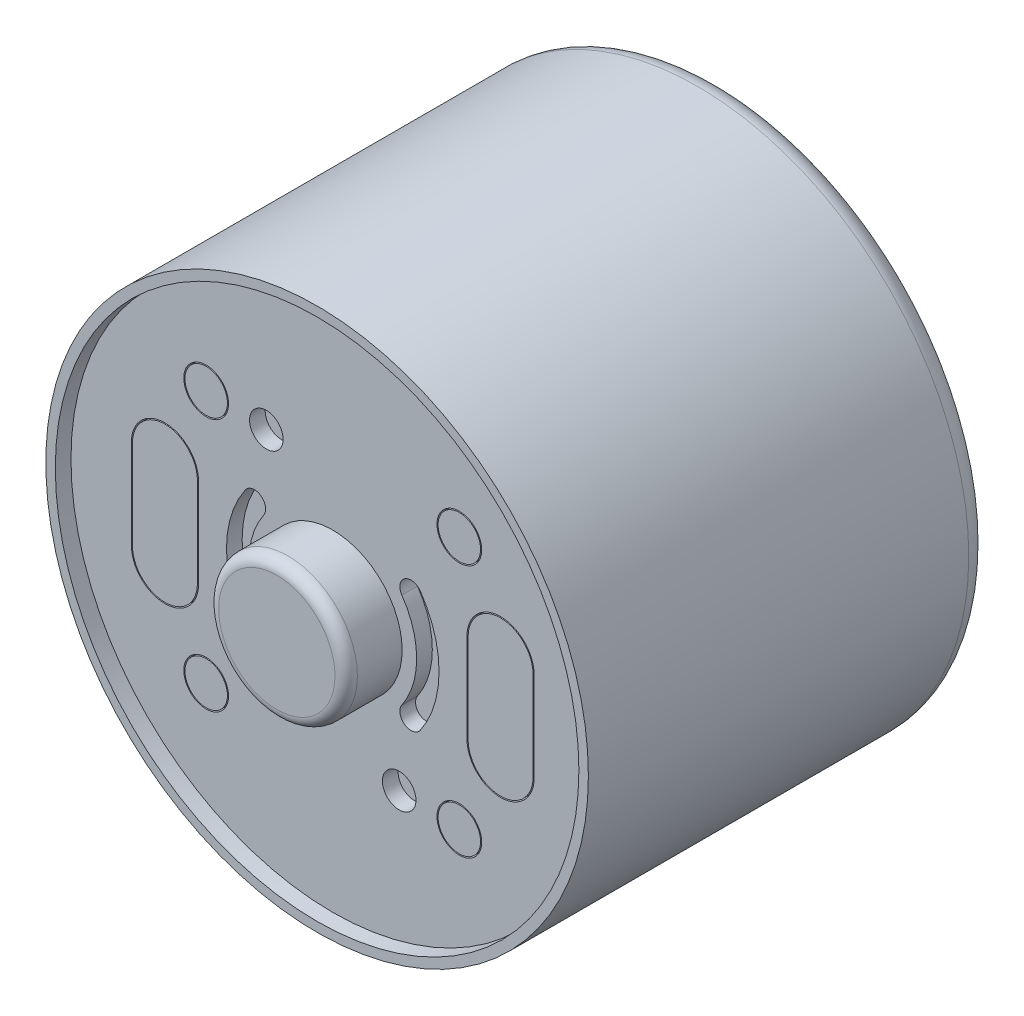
ISO-10303-21;
HEADER;
FILE_DESCRIPTION(('STEP AP214'),'2;1');
FILE_NAME('part.step','',(''),(''),'','','');
FILE_SCHEMA(('AUTOMOTIVE_DESIGN { 1 0 10303 214 1 1 1 1 }'));
ENDSEC;
DATA;
#1=APPLICATION_CONTEXT('core data for automotive mechanical design processes');
#2=APPLICATION_PROTOCOL_DEFINITION('international standard','automotive_design',2000,#1);
#3=PRODUCT_CONTEXT('',#1,'mechanical');
#4=PRODUCT('Part','Part','',(#3));
#5=PRODUCT_RELATED_PRODUCT_CATEGORY('part','',(#4));
#6=PRODUCT_DEFINITION_FORMATION('','',#4);
#7=PRODUCT_DEFINITION_CONTEXT('part definition',#1,'design');
#8=PRODUCT_DEFINITION('design','',#6,#7);
#9=PRODUCT_DEFINITION_SHAPE('','',#8);
#10=(LENGTH_UNIT() NAMED_UNIT(*) SI_UNIT(.MILLI.,.METRE.));
#11=(NAMED_UNIT(*) PLANE_ANGLE_UNIT() SI_UNIT($,.RADIAN.));
#12=(NAMED_UNIT(*) SI_UNIT($,.STERADIAN.) SOLID_ANGLE_UNIT());
#13=UNCERTAINTY_MEASURE_WITH_UNIT(LENGTH_MEASURE(1.E-05),#10,'distance_accuracy_value','');
#14=(GEOMETRIC_REPRESENTATION_CONTEXT(3) GLOBAL_UNCERTAINTY_ASSIGNED_CONTEXT((#13)) GLOBAL_UNIT_ASSIGNED_CONTEXT((#10,
#11,#12)) REPRESENTATION_CONTEXT('',''));
#15=CARTESIAN_POINT('',(0.,0.,0.));
#16=DIRECTION('',(0.,0.,1.));
#17=DIRECTION('',(1.,0.,0.));
#18=AXIS2_PLACEMENT_3D('',#15,#16,#17);
#19=CARTESIAN_POINT('',(0.,0.,-0.7));
#20=DIRECTION('',(0.,0.,1.));
#21=DIRECTION('',(1.,0.,0.));
#22=AXIS2_PLACEMENT_3D('',#19,#20,#21);
#23=PLANE('',#22);
#24=CARTESIAN_POINT('',(0.,0.,-0.7));
#25=DIRECTION('',(0.,0.,1.));
#26=DIRECTION('',(1.,0.,0.));
#27=AXIS2_PLACEMENT_3D('',#24,#25,#26);
#28=CIRCLE('',#27,11.7);
#29=CARTESIAN_POINT('',(11.7,0.,-0.7));
#30=VERTEX_POINT('',#29);
#31=EDGE_CURVE('E396',#30,#30,#28,.T.);
#32=ORIENTED_EDGE('',*,*,#31,.T.);
#33=EDGE_LOOP('',(#32));
#34=FACE_BOUND('',#33,.T.);
#35=CARTESIAN_POINT('',(0.,0.,-0.7));
#36=DIRECTION('',(0.,0.,1.));
#37=DIRECTION('',(1.,0.,0.));
#38=AXIS2_PLACEMENT_3D('',#35,#36,#37);
#39=CIRCLE('',#38,4.75);
#40=CARTESIAN_POINT('',(-3.91176470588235,2.69454947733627,-0.7));
#41=VERTEX_POINT('',#40);
#42=CARTESIAN_POINT('',(-3.91176470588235,-2.69454947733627,-0.7));
#43=VERTEX_POINT('',#42);
#44=EDGE_CURVE('E355',#41,#43,#39,.T.);
#45=ORIENTED_EDGE('',*,*,#44,.F.);
#46=CARTESIAN_POINT('',(-3.5,2.41091269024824,-0.7));
#47=DIRECTION('',(0.,0.,1.));
#48=DIRECTION('',(1.,0.,0.));
#49=AXIS2_PLACEMENT_3D('',#46,#47,#48);
#50=CIRCLE('',#49,0.5);
#51=CARTESIAN_POINT('',(-3.08823529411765,2.12727590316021,-0.7));
#52=VERTEX_POINT('',#51);
#53=EDGE_CURVE('E369',#52,#41,#50,.T.);
#54=ORIENTED_EDGE('',*,*,#53,.F.);
#55=CARTESIAN_POINT('',(0.,0.,-0.7));
#56=DIRECTION('',(0.,0.,-1.));
#57=DIRECTION('',(1.,0.,0.));
#58=AXIS2_PLACEMENT_3D('',#55,#56,#57);
#59=CIRCLE('',#58,3.75);
#60=CARTESIAN_POINT('',(-3.08823529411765,-2.12727590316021,-0.7));
#61=VERTEX_POINT('',#60);
#62=EDGE_CURVE('E366',#61,#52,#59,.T.);
#63=ORIENTED_EDGE('',*,*,#62,.F.);
#64=CARTESIAN_POINT('',(-3.5,-2.41091269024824,-0.7));
#65=DIRECTION('',(0.,0.,1.));
#66=DIRECTION('',(1.,0.,0.));
#67=AXIS2_PLACEMENT_3D('',#64,#65,#66);
#68=CIRCLE('',#67,0.5);
#69=EDGE_CURVE('E363',#43,#61,#68,.T.);
#70=ORIENTED_EDGE('',*,*,#69,.F.);
#71=EDGE_LOOP('',(#45,#54,#63,#70));
#72=FACE_BOUND('',#71,.T.);
#73=CARTESIAN_POINT('',(3.5,-2.41091269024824,-0.7));
#74=DIRECTION('',(0.,0.,1.));
#75=DIRECTION('',(1.,0.,0.));
#76=AXIS2_PLACEMENT_3D('',#73,#74,#75);
#77=CIRCLE('',#76,0.5);
#78=CARTESIAN_POINT('',(3.08823529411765,-2.12727590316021,-0.7));
#79=VERTEX_POINT('',#78);
#80=CARTESIAN_POINT('',(3.91176470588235,-2.69454947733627,-0.7));
#81=VERTEX_POINT('',#80);
#82=EDGE_CURVE('E323',#79,#81,#77,.T.);
#83=ORIENTED_EDGE('',*,*,#82,.F.);
#84=CARTESIAN_POINT('',(0.,0.,-0.7));
#85=DIRECTION('',(0.,0.,-1.));
#86=DIRECTION('',(1.,0.,0.));
#87=AXIS2_PLACEMENT_3D('',#84,#85,#86);
#88=CIRCLE('',#87,3.75);
#89=CARTESIAN_POINT('',(3.08823529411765,2.12727590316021,-0.7));
#90=VERTEX_POINT('',#89);
#91=EDGE_CURVE('E337',#90,#79,#88,.T.);
#92=ORIENTED_EDGE('',*,*,#91,.F.);
#93=CARTESIAN_POINT('',(3.5,2.41091269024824,-0.7));
#94=DIRECTION('',(0.,0.,1.));
#95=DIRECTION('',(1.,0.,0.));
#96=AXIS2_PLACEMENT_3D('',#93,#94,#95);
#97=CIRCLE('',#96,0.5);
#98=CARTESIAN_POINT('',(3.91176470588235,2.69454947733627,-0.7));
#99=VERTEX_POINT('',#98);
#100=EDGE_CURVE('E334',#99,#90,#97,.T.);
#101=ORIENTED_EDGE('',*,*,#100,.F.);
#102=CARTESIAN_POINT('',(0.,0.,-0.7));
#103=DIRECTION('',(0.,0.,1.));
#104=DIRECTION('',(1.,0.,0.));
#105=AXIS2_PLACEMENT_3D('',#102,#103,#104);
#106=CIRCLE('',#105,4.75);
#107=EDGE_CURVE('E331',#81,#99,#106,.T.);
#108=ORIENTED_EDGE('',*,*,#107,.F.);
#109=EDGE_LOOP('',(#83,#92,#101,#108));
#110=FACE_BOUND('',#109,.T.);
#111=CARTESIAN_POINT('',(7.5,-2.,-0.7));
#112=DIRECTION('',(0.,0.,1.));
#113=DIRECTION('',(-1.,0.,0.));
#114=AXIS2_PLACEMENT_3D('',#111,#112,#113);
#115=CIRCLE('',#114,1.5);
#116=CARTESIAN_POINT('',(6.,-2.,-0.7));
#117=VERTEX_POINT('',#116);
#118=CARTESIAN_POINT('',(9.,-2.,-0.7));
#119=VERTEX_POINT('',#118);
#120=EDGE_CURVE('E291',#117,#119,#115,.T.);
#121=ORIENTED_EDGE('',*,*,#120,.F.);
#122=DIRECTION('',(0.,-1.,0.));
#123=VECTOR('',#122,1.);
#124=CARTESIAN_POINT('',(6.,2.,-0.7));
#125=LINE('',#124,#123);
#126=CARTESIAN_POINT('',(6.,2.,-0.7));
#127=VERTEX_POINT('',#126);
#128=EDGE_CURVE('E305',#127,#117,#125,.T.);
#129=ORIENTED_EDGE('',*,*,#128,.F.);
#130=CARTESIAN_POINT('',(7.5,2.,-0.7));
#131=DIRECTION('',(0.,0.,1.));
#132=DIRECTION('',(-1.,0.,0.));
#133=AXIS2_PLACEMENT_3D('',#130,#131,#132);
#134=CIRCLE('',#133,1.5);
#135=CARTESIAN_POINT('',(9.,2.,-0.7));
#136=VERTEX_POINT('',#135);
#137=EDGE_CURVE('E302',#136,#127,#134,.T.);
#138=ORIENTED_EDGE('',*,*,#137,.F.);
#139=DIRECTION('',(0.,1.,0.));
#140=VECTOR('',#139,1.);
#141=CARTESIAN_POINT('',(9.,2.,-0.7));
#142=LINE('',#141,#140);
#143=EDGE_CURVE('E299',#119,#136,#142,.T.);
#144=ORIENTED_EDGE('',*,*,#143,.F.);
#145=EDGE_LOOP('',(#121,#129,#138,#144));
#146=FACE_BOUND('',#145,.T.);
#147=CARTESIAN_POINT('',(-7.5,2.,-0.7));
#148=DIRECTION('',(0.,0.,1.));
#149=DIRECTION('',(1.,0.,0.));
#150=AXIS2_PLACEMENT_3D('',#147,#148,#149);
#151=CIRCLE('',#150,1.5);
#152=CARTESIAN_POINT('',(-6.,2.,-0.7));
#153=VERTEX_POINT('',#152);
#154=CARTESIAN_POINT('',(-9.,2.,-0.7));
#155=VERTEX_POINT('',#154);
#156=EDGE_CURVE('E50',#153,#155,#151,.T.);
#157=ORIENTED_EDGE('',*,*,#156,.F.);
#158=DIRECTION('',(0.,1.,0.));
#159=VECTOR('',#158,1.);
#160=CARTESIAN_POINT('',(-6.,2.,-0.7));
#161=LINE('',#160,#159);
#162=CARTESIAN_POINT('',(-6.,-2.,-0.7));
#163=VERTEX_POINT('',#162);
#164=EDGE_CURVE('E241',#163,#153,#161,.T.);
#165=ORIENTED_EDGE('',*,*,#164,.F.);
#166=CARTESIAN_POINT('',(-7.5,-2.,-0.7));
#167=DIRECTION('',(0.,0.,1.));
#168=DIRECTION('',(1.,0.,0.));
#169=AXIS2_PLACEMENT_3D('',#166,#167,#168);
#170=CIRCLE('',#169,1.5);
#171=CARTESIAN_POINT('',(-9.,-2.,-0.7));
#172=VERTEX_POINT('',#171);
#173=EDGE_CURVE('E238',#172,#163,#170,.T.);
#174=ORIENTED_EDGE('',*,*,#173,.F.);
#175=DIRECTION('',(0.,-1.,0.));
#176=VECTOR('',#175,1.);
#177=CARTESIAN_POINT('',(-9.,2.,-0.7));
#178=LINE('',#177,#176);
#179=EDGE_CURVE('E235',#155,#172,#178,.T.);
#180=ORIENTED_EDGE('',*,*,#179,.F.);
#181=EDGE_LOOP('',(#157,#165,#174,#180));
#182=FACE_BOUND('',#181,.T.);
#183=CARTESIAN_POINT('',(-2.96858552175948,5.5,-0.7));
#184=DIRECTION('',(0.,0.,1.));
#185=DIRECTION('',(1.,0.,0.));
#186=AXIS2_PLACEMENT_3D('',#183,#184,#185);
#187=CIRCLE('',#186,0.75);
#188=CARTESIAN_POINT('',(-2.21858552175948,5.5,-0.7));
#189=VERTEX_POINT('',#188);
#190=EDGE_CURVE('E583',#189,#189,#187,.T.);
#191=ORIENTED_EDGE('',*,*,#190,.F.);
#192=EDGE_LOOP('',(#191));
#193=FACE_BOUND('',#192,.T.);
#194=CARTESIAN_POINT('',(2.96858552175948,-5.5,-0.7));
#195=DIRECTION('',(0.,0.,1.));
#196=DIRECTION('',(1.,0.,0.));
#197=AXIS2_PLACEMENT_3D('',#194,#195,#196);
#198=CIRCLE('',#197,0.75);
#199=CARTESIAN_POINT('',(3.71858552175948,-5.5,-0.7));
#200=VERTEX_POINT('',#199);
#201=EDGE_CURVE('E577',#200,#200,#198,.T.);
#202=ORIENTED_EDGE('',*,*,#201,.F.);
#203=EDGE_LOOP('',(#202));
#204=FACE_BOUND('',#203,.T.);
#205=CARTESIAN_POINT('',(-5.65685424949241,5.65685424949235,-0.7));
#206=DIRECTION('',(0.,0.,1.));
#207=DIRECTION('',(1.,0.,0.));
#208=AXIS2_PLACEMENT_3D('',#205,#206,#207);
#209=CIRCLE('',#208,1.);
#210=CARTESIAN_POINT('',(-4.65685424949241,5.65685424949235,-0.7));
#211=VERTEX_POINT('',#210);
#212=EDGE_CURVE('E571',#211,#211,#209,.T.);
#213=ORIENTED_EDGE('',*,*,#212,.F.);
#214=EDGE_LOOP('',(#213));
#215=FACE_BOUND('',#214,.T.);
#216=CARTESIAN_POINT('',(-5.65685424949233,-5.65685424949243,-0.7));
#217=DIRECTION('',(0.,0.,1.));
#218=DIRECTION('',(1.,0.,0.));
#219=AXIS2_PLACEMENT_3D('',#216,#217,#218);
#220=CIRCLE('',#219,1.);
#221=CARTESIAN_POINT('',(-4.65685424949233,-5.65685424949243,-0.7));
#222=VERTEX_POINT('',#221);
#223=EDGE_CURVE('E560',#222,#222,#220,.T.);
#224=ORIENTED_EDGE('',*,*,#223,.F.);
#225=EDGE_LOOP('',(#224));
#226=FACE_BOUND('',#225,.T.);
#227=CARTESIAN_POINT('',(5.65685424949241,-5.65685424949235,-0.7));
#228=DIRECTION('',(0.,0.,1.));
#229=DIRECTION('',(1.,0.,0.));
#230=AXIS2_PLACEMENT_3D('',#227,#228,#229);
#231=CIRCLE('',#230,1.);
#232=CARTESIAN_POINT('',(6.65685424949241,-5.65685424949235,-0.7));
#233=VERTEX_POINT('',#232);
#234=EDGE_CURVE('E543',#233,#233,#231,.T.);
#235=ORIENTED_EDGE('',*,*,#234,.F.);
#236=EDGE_LOOP('',(#235));
#237=FACE_BOUND('',#236,.T.);
#238=CARTESIAN_POINT('',(5.65685424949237,5.65685424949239,-0.7));
#239=DIRECTION('',(0.,0.,1.));
#240=DIRECTION('',(1.,0.,0.));
#241=AXIS2_PLACEMENT_3D('',#238,#239,#240);
#242=CIRCLE('',#241,1.);
#243=CARTESIAN_POINT('',(6.65685424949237,5.65685424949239,-0.7));
#244=VERTEX_POINT('',#243);
#245=EDGE_CURVE('E546',#244,#244,#242,.T.);
#246=ORIENTED_EDGE('',*,*,#245,.F.);
#247=EDGE_LOOP('',(#246));
#248=FACE_BOUND('',#247,.T.);
#249=CARTESIAN_POINT('',(0.,0.,-0.7));
#250=DIRECTION('',(0.,0.,1.));
#251=DIRECTION('',(1.,0.,0.));
#252=AXIS2_PLACEMENT_3D('',#249,#250,#251);
#253=CIRCLE('',#252,3.1);
#254=CARTESIAN_POINT('',(3.1,0.,-0.7));
#255=VERTEX_POINT('',#254);
#256=EDGE_CURVE('E626',#255,#255,#253,.T.);
#257=ORIENTED_EDGE('',*,*,#256,.F.);
#258=EDGE_LOOP('',(#257));
#259=FACE_BOUND('',#258,.T.);
#260=ADVANCED_FACE('F35',(#34,#72,#110,#146,#182,#193,#204,#215,#226,#237,#248,#259),#23,.T.);
#261=CARTESIAN_POINT('',(0.,0.,-18.));
#262=DIRECTION('',(0.,0.,1.));
#263=DIRECTION('',(1.,0.,0.));
#264=AXIS2_PLACEMENT_3D('',#261,#262,#263);
#265=PLANE('',#264);
#266=CARTESIAN_POINT('',(0.,0.,-18.));
#267=DIRECTION('',(0.,0.,1.));
#268=DIRECTION('',(1.,0.,0.));
#269=AXIS2_PLACEMENT_3D('',#266,#267,#268);
#270=CIRCLE('',#269,11.125);
#271=CARTESIAN_POINT('',(11.125,0.,-18.));
#272=VERTEX_POINT('',#271);
#273=EDGE_CURVE('E421',#272,#272,#270,.F.);
#274=ORIENTED_EDGE('',*,*,#273,.T.);
#275=EDGE_LOOP('',(#274));
#276=FACE_BOUND('',#275,.T.);
#277=CARTESIAN_POINT('',(0.,0.,-18.));
#278=DIRECTION('',(0.,0.,1.));
#279=DIRECTION('',(1.,0.,0.));
#280=AXIS2_PLACEMENT_3D('',#277,#278,#279);
#281=CIRCLE('',#280,3.25);
#282=CARTESIAN_POINT('',(3.25,0.,-18.));
#283=VERTEX_POINT('',#282);
#284=EDGE_CURVE('E430',#283,#283,#281,.F.);
#285=ORIENTED_EDGE('',*,*,#284,.F.);
#286=EDGE_LOOP('',(#285));
#287=FACE_BOUND('',#286,.T.);
#288=ADVANCED_FACE('F450',(#276,#287),#265,.F.);
#289=CARTESIAN_POINT('',(0.,0.,-18.));
#290=DIRECTION('',(0.,0.,1.));
#291=DIRECTION('',(1.,0.,0.));
#292=AXIS2_PLACEMENT_3D('',#289,#290,#291);
#293=CYLINDRICAL_SURFACE('',#292,12.125);
#294=CARTESIAN_POINT('',(0.,0.,-17.));
#295=DIRECTION('',(0.,0.,1.));
#296=DIRECTION('',(1.,0.,0.));
#297=AXIS2_PLACEMENT_3D('',#294,#295,#296);
#298=CIRCLE('',#297,12.125);
#299=CARTESIAN_POINT('',(12.125,0.,-17.));
#300=VERTEX_POINT('',#299);
#301=EDGE_CURVE('E418',#300,#300,#298,.T.);
#302=ORIENTED_EDGE('',*,*,#301,.T.);
#303=EDGE_LOOP('',(#302));
#304=FACE_BOUND('',#303,.T.);
#305=CARTESIAN_POINT('',(0.,0.,0.));
#306=DIRECTION('',(0.,0.,1.));
#307=DIRECTION('',(1.,0.,0.));
#308=AXIS2_PLACEMENT_3D('',#305,#306,#307);
#309=CIRCLE('',#308,12.125);
#310=CARTESIAN_POINT('',(12.125,0.,0.));
#311=VERTEX_POINT('',#310);
#312=EDGE_CURVE('E415',#311,#311,#309,.T.);
#313=ORIENTED_EDGE('',*,*,#312,.F.);
#314=EDGE_LOOP('',(#313));
#315=FACE_BOUND('',#314,.T.);
#316=ADVANCED_FACE('F37',(#304,#315),#293,.T.);
#317=CARTESIAN_POINT('',(0.,0.,0.));
#318=DIRECTION('',(0.,0.,1.));
#319=DIRECTION('',(1.,0.,0.));
#320=AXIS2_PLACEMENT_3D('',#317,#318,#319);
#321=PLANE('',#320);
#322=CARTESIAN_POINT('',(0.,0.,0.));
#323=DIRECTION('',(0.,0.,1.));
#324=DIRECTION('',(1.,0.,0.));
#325=AXIS2_PLACEMENT_3D('',#322,#323,#324);
#326=CIRCLE('',#325,11.7);
#327=CARTESIAN_POINT('',(11.7,0.,0.));
#328=VERTEX_POINT('',#327);
#329=EDGE_CURVE('E387',#328,#328,#326,.T.);
#330=ORIENTED_EDGE('',*,*,#329,.F.);
#331=EDGE_LOOP('',(#330));
#332=FACE_BOUND('',#331,.T.);
#333=ORIENTED_EDGE('',*,*,#312,.T.);
#334=EDGE_LOOP('',(#333));
#335=FACE_BOUND('',#334,.T.);
#336=ADVANCED_FACE('F824',(#332,#335),#321,.T.);
#337=CARTESIAN_POINT('',(0.,0.,-17.));
#338=DIRECTION('',(0.,0.,1.));
#339=DIRECTION('',(1.,0.,0.));
#340=AXIS2_PLACEMENT_3D('',#337,#338,#339);
#341=TOROIDAL_SURFACE('',#340,11.125,1.);
#342=ORIENTED_EDGE('',*,*,#273,.F.);
#343=EDGE_LOOP('',(#342));
#344=FACE_BOUND('',#343,.T.);
#345=ORIENTED_EDGE('',*,*,#301,.F.);
#346=EDGE_LOOP('',(#345));
#347=FACE_BOUND('',#346,.T.);
#348=ADVANCED_FACE('F813',(#344,#347),#341,.T.);
#349=CARTESIAN_POINT('',(0.,0.,-18.5));
#350=DIRECTION('',(0.,0.,-1.));
#351=DIRECTION('',(-1.,0.,0.));
#352=AXIS2_PLACEMENT_3D('',#349,#350,#351);
#353=PLANE('',#352);
#354=CARTESIAN_POINT('',(0.,0.,-18.5));
#355=DIRECTION('',(0.,0.,-1.));
#356=DIRECTION('',(-1.,0.,0.));
#357=AXIS2_PLACEMENT_3D('',#354,#355,#356);
#358=CIRCLE('',#357,2.5);
#359=CARTESIAN_POINT('',(-2.5,0.,-18.5));
#360=VERTEX_POINT('',#359);
#361=EDGE_CURVE('E405',#360,#360,#358,.T.);
#362=ORIENTED_EDGE('',*,*,#361,.F.);
#363=EDGE_LOOP('',(#362));
#364=FACE_BOUND('',#363,.T.);
#365=CARTESIAN_POINT('',(0.,0.,-18.5));
#366=DIRECTION('',(0.,0.,-1.));
#367=DIRECTION('',(-1.,0.,0.));
#368=AXIS2_PLACEMENT_3D('',#365,#366,#367);
#369=CIRCLE('',#368,3.25);
#370=CARTESIAN_POINT('',(-3.25,0.,-18.5));
#371=VERTEX_POINT('',#370);
#372=EDGE_CURVE('E411',#371,#371,#369,.T.);
#373=ORIENTED_EDGE('',*,*,#372,.T.);
#374=EDGE_LOOP('',(#373));
#375=FACE_BOUND('',#374,.T.);
#376=ADVANCED_FACE('F794',(#364,#375),#353,.T.);
#377=CARTESIAN_POINT('',(0.,0.,-18.5));
#378=DIRECTION('',(0.,0.,1.));
#379=DIRECTION('',(1.,0.,0.));
#380=AXIS2_PLACEMENT_3D('',#377,#378,#379);
#381=CYLINDRICAL_SURFACE('',#380,3.25);
#382=ORIENTED_EDGE('',*,*,#372,.F.);
#383=EDGE_LOOP('',(#382));
#384=FACE_BOUND('',#383,.T.);
#385=ORIENTED_EDGE('',*,*,#284,.T.);
#386=EDGE_LOOP('',(#385));
#387=FACE_BOUND('',#386,.T.);
#388=ADVANCED_FACE('F809',(#384,#387),#381,.T.);
#389=CARTESIAN_POINT('',(0.,0.,-18.4));
#390=DIRECTION('',(0.,0.,-1.));
#391=DIRECTION('',(-1.,0.,0.));
#392=AXIS2_PLACEMENT_3D('',#389,#390,#391);
#393=CYLINDRICAL_SURFACE('',#392,2.5);
#394=CARTESIAN_POINT('',(0.,0.,-18.4));
#395=DIRECTION('',(0.,0.,-1.));
#396=DIRECTION('',(-1.,0.,0.));
#397=AXIS2_PLACEMENT_3D('',#394,#395,#396);
#398=CIRCLE('',#397,2.5);
#399=CARTESIAN_POINT('',(-2.5,0.,-18.4));
#400=VERTEX_POINT('',#399);
#401=EDGE_CURVE('E408',#400,#400,#398,.T.);
#402=ORIENTED_EDGE('',*,*,#401,.F.);
#403=EDGE_LOOP('',(#402));
#404=FACE_BOUND('',#403,.T.);
#405=ORIENTED_EDGE('',*,*,#361,.T.);
#406=EDGE_LOOP('',(#405));
#407=FACE_BOUND('',#406,.T.);
#408=ADVANCED_FACE('F806',(#404,#407),#393,.F.);
#409=CARTESIAN_POINT('',(0.,0.,-18.4));
#410=DIRECTION('',(0.,0.,-1.));
#411=DIRECTION('',(-1.,0.,0.));
#412=AXIS2_PLACEMENT_3D('',#409,#410,#411);
#413=PLANE('',#412);
#414=CARTESIAN_POINT('',(0.,0.,-18.4));
#415=DIRECTION('',(0.,0.,-1.));
#416=DIRECTION('',(-1.,0.,0.));
#417=AXIS2_PLACEMENT_3D('',#414,#415,#416);
#418=CIRCLE('',#417,2.45);
#419=CARTESIAN_POINT('',(-2.45,0.,-18.4));
#420=VERTEX_POINT('',#419);
#421=EDGE_CURVE('E402',#420,#420,#418,.T.);
#422=ORIENTED_EDGE('',*,*,#421,.F.);
#423=EDGE_LOOP('',(#422));
#424=FACE_BOUND('',#423,.T.);
#425=ORIENTED_EDGE('',*,*,#401,.T.);
#426=EDGE_LOOP('',(#425));
#427=FACE_BOUND('',#426,.T.);
#428=ADVANCED_FACE('F802',(#424,#427),#413,.T.);
#429=CARTESIAN_POINT('',(0.,0.,-18.4));
#430=DIRECTION('',(0.,0.,-1.));
#431=DIRECTION('',(-1.,0.,0.));
#432=AXIS2_PLACEMENT_3D('',#429,#430,#431);
#433=CYLINDRICAL_SURFACE('',#432,2.45);
#434=ORIENTED_EDGE('',*,*,#421,.T.);
#435=EDGE_LOOP('',(#434));
#436=FACE_BOUND('',#435,.T.);
#437=CARTESIAN_POINT('',(0.,0.,-18.5));
#438=DIRECTION('',(0.,0.,-1.));
#439=DIRECTION('',(-1.,0.,0.));
#440=AXIS2_PLACEMENT_3D('',#437,#438,#439);
#441=CIRCLE('',#440,2.45);
#442=CARTESIAN_POINT('',(-2.45,0.,-18.5));
#443=VERTEX_POINT('',#442);
#444=EDGE_CURVE('E399',#443,#443,#441,.T.);
#445=ORIENTED_EDGE('',*,*,#444,.F.);
#446=EDGE_LOOP('',(#445));
#447=FACE_BOUND('',#446,.T.);
#448=ADVANCED_FACE('F798',(#436,#447),#433,.T.);
#449=CARTESIAN_POINT('',(0.,0.,-25.));
#450=DIRECTION('',(0.,0.,-1.));
#451=DIRECTION('',(-1.,0.,0.));
#452=AXIS2_PLACEMENT_3D('',#449,#450,#451);
#453=PLANE('',#452);
#454=CARTESIAN_POINT('',(0.,0.,-25.));
#455=DIRECTION('',(0.,0.,-1.));
#456=DIRECTION('',(-1.,0.,0.));
#457=AXIS2_PLACEMENT_3D('',#454,#455,#456);
#458=CIRCLE('',#457,0.8);
#459=CARTESIAN_POINT('',(-0.8,0.,-25.));
#460=VERTEX_POINT('',#459);
#461=EDGE_CURVE('E424',#460,#460,#458,.T.);
#462=ORIENTED_EDGE('',*,*,#461,.T.);
#463=EDGE_LOOP('',(#462));
#464=FACE_BOUND('',#463,.T.);
#465=ADVANCED_FACE('F801',(#464),#453,.T.);
#466=CARTESIAN_POINT('',(0.,0.,-24.8));
#467=DIRECTION('',(0.,0.,-1.));
#468=DIRECTION('',(-1.,0.,0.));
#469=AXIS2_PLACEMENT_3D('',#466,#467,#468);
#470=TOROIDAL_SURFACE('',#469,0.8,0.2);
#471=CARTESIAN_POINT('',(0.,0.,-24.8));
#472=DIRECTION('',(0.,0.,-1.));
#473=DIRECTION('',(-1.,0.,0.));
#474=AXIS2_PLACEMENT_3D('',#471,#472,#473);
#475=CIRCLE('',#474,1.);
#476=CARTESIAN_POINT('',(-1.,0.,-24.8));
#477=VERTEX_POINT('',#476);
#478=EDGE_CURVE('E427',#477,#477,#475,.F.);
#479=ORIENTED_EDGE('',*,*,#478,.F.);
#480=EDGE_LOOP('',(#479));
#481=FACE_BOUND('',#480,.T.);
#482=ORIENTED_EDGE('',*,*,#461,.F.);
#483=EDGE_LOOP('',(#482));
#484=FACE_BOUND('',#483,.T.);
#485=ADVANCED_FACE('F818',(#481,#484),#470,.T.);
#486=CARTESIAN_POINT('',(0.,0.,-25.));
#487=DIRECTION('',(0.,0.,1.));
#488=DIRECTION('',(1.,0.,0.));
#489=AXIS2_PLACEMENT_3D('',#486,#487,#488);
#490=CYLINDRICAL_SURFACE('',#489,1.);
#491=CARTESIAN_POINT('',(0.,0.,-18.5));
#492=DIRECTION('',(0.,0.,-1.));
#493=DIRECTION('',(-1.,0.,0.));
#494=AXIS2_PLACEMENT_3D('',#491,#492,#493);
#495=CIRCLE('',#494,1.);
#496=CARTESIAN_POINT('',(-1.,0.,-18.5));
#497=VERTEX_POINT('',#496);
#498=EDGE_CURVE('E414',#497,#497,#495,.T.);
#499=ORIENTED_EDGE('',*,*,#498,.T.);
#500=EDGE_LOOP('',(#499));
#501=FACE_BOUND('',#500,.T.);
#502=ORIENTED_EDGE('',*,*,#478,.T.);
#503=EDGE_LOOP('',(#502));
#504=FACE_BOUND('',#503,.T.);
#505=ADVANCED_FACE('F791',(#501,#504),#490,.T.);
#506=ORIENTED_EDGE('',*,*,#498,.F.);
#507=EDGE_LOOP('',(#506));
#508=FACE_BOUND('',#507,.T.);
#509=ORIENTED_EDGE('',*,*,#444,.T.);
#510=EDGE_LOOP('',(#509));
#511=FACE_BOUND('',#510,.T.);
#512=ADVANCED_FACE('F759',(#508,#511),#353,.T.);
#513=CARTESIAN_POINT('',(0.,0.,-0.7));
#514=DIRECTION('',(0.,0.,1.));
#515=DIRECTION('',(1.,0.,0.));
#516=AXIS2_PLACEMENT_3D('',#513,#514,#515);
#517=CYLINDRICAL_SURFACE('',#516,11.7);
#518=ORIENTED_EDGE('',*,*,#31,.F.);
#519=EDGE_LOOP('',(#518));
#520=FACE_BOUND('',#519,.T.);
#521=ORIENTED_EDGE('',*,*,#329,.T.);
#522=EDGE_LOOP('',(#521));
#523=FACE_BOUND('',#522,.T.);
#524=ADVANCED_FACE('F754',(#520,#523),#517,.F.);
#525=CARTESIAN_POINT('',(0.,0.,-1.4));
#526=DIRECTION('',(0.,0.,1.));
#527=DIRECTION('',(1.,0.,0.));
#528=AXIS2_PLACEMENT_3D('',#525,#526,#527);
#529=CYLINDRICAL_SURFACE('',#528,4.75);
#530=ORIENTED_EDGE('',*,*,#44,.T.);
#531=DIRECTION('',(0.,0.,1.));
#532=VECTOR('',#531,1.);
#533=CARTESIAN_POINT('',(-3.91176470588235,-2.69454947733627,-1.4));
#534=LINE('',#533,#532);
#535=CARTESIAN_POINT('',(-3.91176470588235,-2.69454947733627,-1.4));
#536=VERTEX_POINT('',#535);
#537=EDGE_CURVE('E384',#536,#43,#534,.T.);
#538=ORIENTED_EDGE('',*,*,#537,.F.);
#539=CARTESIAN_POINT('',(0.,0.,-1.4));
#540=DIRECTION('',(0.,0.,1.));
#541=DIRECTION('',(1.,0.,0.));
#542=AXIS2_PLACEMENT_3D('',#539,#540,#541);
#543=CIRCLE('',#542,4.75);
#544=CARTESIAN_POINT('',(-3.91176470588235,2.69454947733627,-1.4));
#545=VERTEX_POINT('',#544);
#546=EDGE_CURVE('E372',#545,#536,#543,.T.);
#547=ORIENTED_EDGE('',*,*,#546,.F.);
#548=DIRECTION('',(0.,0.,1.));
#549=VECTOR('',#548,1.);
#550=CARTESIAN_POINT('',(-3.91176470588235,2.69454947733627,-1.4));
#551=LINE('',#550,#549);
#552=EDGE_CURVE('E385',#545,#41,#551,.T.);
#553=ORIENTED_EDGE('',*,*,#552,.T.);
#554=EDGE_LOOP('',(#530,#538,#547,#553));
#555=FACE_BOUND('',#554,.T.);
#556=ADVANCED_FACE('F746',(#555),#529,.F.);
#557=CARTESIAN_POINT('',(-3.5,2.41091269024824,-1.4));
#558=DIRECTION('',(0.,0.,1.));
#559=DIRECTION('',(1.,0.,0.));
#560=AXIS2_PLACEMENT_3D('',#557,#558,#559);
#561=CYLINDRICAL_SURFACE('',#560,0.5);
#562=ORIENTED_EDGE('',*,*,#53,.T.);
#563=ORIENTED_EDGE('',*,*,#552,.F.);
#564=CARTESIAN_POINT('',(-3.5,2.41091269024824,-1.4));
#565=DIRECTION('',(0.,0.,1.));
#566=DIRECTION('',(1.,0.,0.));
#567=AXIS2_PLACEMENT_3D('',#564,#565,#566);
#568=CIRCLE('',#567,0.5);
#569=CARTESIAN_POINT('',(-3.08823529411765,2.12727590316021,-1.4));
#570=VERTEX_POINT('',#569);
#571=EDGE_CURVE('E381',#570,#545,#568,.T.);
#572=ORIENTED_EDGE('',*,*,#571,.F.);
#573=DIRECTION('',(0.,0.,1.));
#574=VECTOR('',#573,1.);
#575=CARTESIAN_POINT('',(-3.08823529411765,2.12727590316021,-1.4));
#576=LINE('',#575,#574);
#577=EDGE_CURVE('E388',#570,#52,#576,.T.);
#578=ORIENTED_EDGE('',*,*,#577,.T.);
#579=EDGE_LOOP('',(#562,#563,#572,#578));
#580=FACE_BOUND('',#579,.T.);
#581=ADVANCED_FACE('F742',(#580),#561,.F.);
#582=CARTESIAN_POINT('',(0.,0.,-1.4));
#583=DIRECTION('',(0.,0.,1.));
#584=DIRECTION('',(1.,0.,0.));
#585=AXIS2_PLACEMENT_3D('',#582,#583,#584);
#586=CYLINDRICAL_SURFACE('',#585,3.75);
#587=ORIENTED_EDGE('',*,*,#62,.T.);
#588=ORIENTED_EDGE('',*,*,#577,.F.);
#589=CARTESIAN_POINT('',(0.,0.,-1.4));
#590=DIRECTION('',(0.,0.,-1.));
#591=DIRECTION('',(1.,0.,0.));
#592=AXIS2_PLACEMENT_3D('',#589,#590,#591);
#593=CIRCLE('',#592,3.75);
#594=CARTESIAN_POINT('',(-3.08823529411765,-2.12727590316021,-1.4));
#595=VERTEX_POINT('',#594);
#596=EDGE_CURVE('E378',#595,#570,#593,.T.);
#597=ORIENTED_EDGE('',*,*,#596,.F.);
#598=DIRECTION('',(0.,0.,1.));
#599=VECTOR('',#598,1.);
#600=CARTESIAN_POINT('',(-3.08823529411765,-2.12727590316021,-1.4));
#601=LINE('',#600,#599);
#602=EDGE_CURVE('E390',#595,#61,#601,.T.);
#603=ORIENTED_EDGE('',*,*,#602,.T.);
#604=EDGE_LOOP('',(#587,#588,#597,#603));
#605=FACE_BOUND('',#604,.T.);
#606=ADVANCED_FACE('F745',(#605),#586,.T.);
#607=CARTESIAN_POINT('',(-3.5,-2.41091269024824,-1.4));
#608=DIRECTION('',(0.,0.,1.));
#609=DIRECTION('',(1.,0.,0.));
#610=AXIS2_PLACEMENT_3D('',#607,#608,#609);
#611=CYLINDRICAL_SURFACE('',#610,0.5);
#612=ORIENTED_EDGE('',*,*,#69,.T.);
#613=ORIENTED_EDGE('',*,*,#602,.F.);
#614=CARTESIAN_POINT('',(-3.5,-2.41091269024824,-1.4));
#615=DIRECTION('',(0.,0.,1.));
#616=DIRECTION('',(1.,0.,0.));
#617=AXIS2_PLACEMENT_3D('',#614,#615,#616);
#618=CIRCLE('',#617,0.5);
#619=EDGE_CURVE('E375',#536,#595,#618,.T.);
#620=ORIENTED_EDGE('',*,*,#619,.F.);
#621=ORIENTED_EDGE('',*,*,#537,.T.);
#622=EDGE_LOOP('',(#612,#613,#620,#621));
#623=FACE_BOUND('',#622,.T.);
#624=ADVANCED_FACE('F740',(#623),#611,.F.);
#625=CARTESIAN_POINT('',(-1.75,-1.20545634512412,-1.4));
#626=DIRECTION('',(0.,0.,1.));
#627=DIRECTION('',(1.,0.,0.));
#628=AXIS2_PLACEMENT_3D('',#625,#626,#627);
#629=PLANE('',#628);
#630=ORIENTED_EDGE('',*,*,#546,.T.);
#631=ORIENTED_EDGE('',*,*,#619,.T.);
#632=ORIENTED_EDGE('',*,*,#596,.T.);
#633=ORIENTED_EDGE('',*,*,#571,.T.);
#634=EDGE_LOOP('',(#630,#631,#632,#633));
#635=FACE_BOUND('',#634,.T.);
#636=ADVANCED_FACE('F736',(#635),#629,.T.);
#637=CARTESIAN_POINT('',(3.5,-2.41091269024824,-1.4));
#638=DIRECTION('',(0.,0.,1.));
#639=DIRECTION('',(1.,0.,0.));
#640=AXIS2_PLACEMENT_3D('',#637,#638,#639);
#641=CYLINDRICAL_SURFACE('',#640,0.5);
#642=ORIENTED_EDGE('',*,*,#82,.T.);
#643=DIRECTION('',(0.,0.,1.));
#644=VECTOR('',#643,1.);
#645=CARTESIAN_POINT('',(3.91176470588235,-2.69454947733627,-1.4));
#646=LINE('',#645,#644);
#647=CARTESIAN_POINT('',(3.91176470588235,-2.69454947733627,-1.4));
#648=VERTEX_POINT('',#647);
#649=EDGE_CURVE('E352',#648,#81,#646,.T.);
#650=ORIENTED_EDGE('',*,*,#649,.F.);
#651=CARTESIAN_POINT('',(3.5,-2.41091269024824,-1.4));
#652=DIRECTION('',(0.,0.,1.));
#653=DIRECTION('',(1.,0.,0.));
#654=AXIS2_PLACEMENT_3D('',#651,#652,#653);
#655=CIRCLE('',#654,0.5);
#656=CARTESIAN_POINT('',(3.08823529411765,-2.12727590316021,-1.4));
#657=VERTEX_POINT('',#656);
#658=EDGE_CURVE('E340',#657,#648,#655,.T.);
#659=ORIENTED_EDGE('',*,*,#658,.F.);
#660=DIRECTION('',(0.,0.,1.));
#661=VECTOR('',#660,1.);
#662=CARTESIAN_POINT('',(3.08823529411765,-2.12727590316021,-1.4));
#663=LINE('',#662,#661);
#664=EDGE_CURVE('E353',#657,#79,#663,.T.);
#665=ORIENTED_EDGE('',*,*,#664,.T.);
#666=EDGE_LOOP('',(#642,#650,#659,#665));
#667=FACE_BOUND('',#666,.T.);
#668=ADVANCED_FACE('F726',(#667),#641,.F.);
#669=CARTESIAN_POINT('',(0.,0.,-1.4));
#670=DIRECTION('',(0.,0.,1.));
#671=DIRECTION('',(1.,0.,0.));
#672=AXIS2_PLACEMENT_3D('',#669,#670,#671);
#673=CYLINDRICAL_SURFACE('',#672,3.75);
#674=ORIENTED_EDGE('',*,*,#91,.T.);
#675=ORIENTED_EDGE('',*,*,#664,.F.);
#676=CARTESIAN_POINT('',(0.,0.,-1.4));
#677=DIRECTION('',(0.,0.,-1.));
#678=DIRECTION('',(1.,0.,0.));
#679=AXIS2_PLACEMENT_3D('',#676,#677,#678);
#680=CIRCLE('',#679,3.75);
#681=CARTESIAN_POINT('',(3.08823529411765,2.12727590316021,-1.4));
#682=VERTEX_POINT('',#681);
#683=EDGE_CURVE('E349',#682,#657,#680,.T.);
#684=ORIENTED_EDGE('',*,*,#683,.F.);
#685=DIRECTION('',(0.,0.,1.));
#686=VECTOR('',#685,1.);
#687=CARTESIAN_POINT('',(3.08823529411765,2.12727590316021,-1.4));
#688=LINE('',#687,#686);
#689=EDGE_CURVE('E356',#682,#90,#688,.T.);
#690=ORIENTED_EDGE('',*,*,#689,.T.);
#691=EDGE_LOOP('',(#674,#675,#684,#690));
#692=FACE_BOUND('',#691,.T.);
#693=ADVANCED_FACE('F722',(#692),#673,.T.);
#694=CARTESIAN_POINT('',(3.5,2.41091269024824,-1.4));
#695=DIRECTION('',(0.,0.,1.));
#696=DIRECTION('',(1.,0.,0.));
#697=AXIS2_PLACEMENT_3D('',#694,#695,#696);
#698=CYLINDRICAL_SURFACE('',#697,0.5);
#699=ORIENTED_EDGE('',*,*,#100,.T.);
#700=ORIENTED_EDGE('',*,*,#689,.F.);
#701=CARTESIAN_POINT('',(3.5,2.41091269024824,-1.4));
#702=DIRECTION('',(0.,0.,1.));
#703=DIRECTION('',(1.,0.,0.));
#704=AXIS2_PLACEMENT_3D('',#701,#702,#703);
#705=CIRCLE('',#704,0.5);
#706=CARTESIAN_POINT('',(3.91176470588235,2.69454947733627,-1.4));
#707=VERTEX_POINT('',#706);
#708=EDGE_CURVE('E346',#707,#682,#705,.T.);
#709=ORIENTED_EDGE('',*,*,#708,.F.);
#710=DIRECTION('',(0.,0.,1.));
#711=VECTOR('',#710,1.);
#712=CARTESIAN_POINT('',(3.91176470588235,2.69454947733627,-1.4));
#713=LINE('',#712,#711);
#714=EDGE_CURVE('E358',#707,#99,#713,.T.);
#715=ORIENTED_EDGE('',*,*,#714,.T.);
#716=EDGE_LOOP('',(#699,#700,#709,#715));
#717=FACE_BOUND('',#716,.T.);
#718=ADVANCED_FACE('F725',(#717),#698,.F.);
#719=CARTESIAN_POINT('',(0.,0.,-1.4));
#720=DIRECTION('',(0.,0.,1.));
#721=DIRECTION('',(1.,0.,0.));
#722=AXIS2_PLACEMENT_3D('',#719,#720,#721);
#723=CYLINDRICAL_SURFACE('',#722,4.75);
#724=ORIENTED_EDGE('',*,*,#107,.T.);
#725=ORIENTED_EDGE('',*,*,#714,.F.);
#726=CARTESIAN_POINT('',(0.,0.,-1.4));
#727=DIRECTION('',(0.,0.,1.));
#728=DIRECTION('',(1.,0.,0.));
#729=AXIS2_PLACEMENT_3D('',#726,#727,#728);
#730=CIRCLE('',#729,4.75);
#731=EDGE_CURVE('E343',#648,#707,#730,.T.);
#732=ORIENTED_EDGE('',*,*,#731,.F.);
#733=ORIENTED_EDGE('',*,*,#649,.T.);
#734=EDGE_LOOP('',(#724,#725,#732,#733));
#735=FACE_BOUND('',#734,.T.);
#736=ADVANCED_FACE('F720',(#735),#723,.F.);
#737=CARTESIAN_POINT('',(1.75,-1.20545634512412,-1.4));
#738=DIRECTION('',(0.,0.,1.));
#739=DIRECTION('',(1.,0.,0.));
#740=AXIS2_PLACEMENT_3D('',#737,#738,#739);
#741=PLANE('',#740);
#742=ORIENTED_EDGE('',*,*,#658,.T.);
#743=ORIENTED_EDGE('',*,*,#731,.T.);
#744=ORIENTED_EDGE('',*,*,#708,.T.);
#745=ORIENTED_EDGE('',*,*,#683,.T.);
#746=EDGE_LOOP('',(#742,#743,#744,#745));
#747=FACE_BOUND('',#746,.T.);
#748=ADVANCED_FACE('F716',(#747),#741,.T.);
#749=CARTESIAN_POINT('',(7.5,-2.,-1.4));
#750=DIRECTION('',(0.,0.,1.));
#751=DIRECTION('',(1.,0.,0.));
#752=AXIS2_PLACEMENT_3D('',#749,#750,#751);
#753=CYLINDRICAL_SURFACE('',#752,1.5);
#754=ORIENTED_EDGE('',*,*,#120,.T.);
#755=DIRECTION('',(0.,0.,1.));
#756=VECTOR('',#755,1.);
#757=CARTESIAN_POINT('',(9.,-2.,-1.4));
#758=LINE('',#757,#756);
#759=CARTESIAN_POINT('',(9.,-2.,-1.4));
#760=VERTEX_POINT('',#759);
#761=EDGE_CURVE('E320',#760,#119,#758,.T.);
#762=ORIENTED_EDGE('',*,*,#761,.F.);
#763=CARTESIAN_POINT('',(7.5,-2.,-1.4));
#764=DIRECTION('',(0.,0.,1.));
#765=DIRECTION('',(-1.,0.,0.));
#766=AXIS2_PLACEMENT_3D('',#763,#764,#765);
#767=CIRCLE('',#766,1.5);
#768=CARTESIAN_POINT('',(6.,-2.,-1.4));
#769=VERTEX_POINT('',#768);
#770=EDGE_CURVE('E308',#769,#760,#767,.T.);
#771=ORIENTED_EDGE('',*,*,#770,.F.);
#772=DIRECTION('',(0.,0.,1.));
#773=VECTOR('',#772,1.);
#774=CARTESIAN_POINT('',(6.,-2.,-1.4));
#775=LINE('',#774,#773);
#776=EDGE_CURVE('E321',#769,#117,#775,.T.);
#777=ORIENTED_EDGE('',*,*,#776,.T.);
#778=EDGE_LOOP('',(#754,#762,#771,#777));
#779=FACE_BOUND('',#778,.T.);
#780=ADVANCED_FACE('F706',(#779),#753,.F.);
#781=CARTESIAN_POINT('',(6.,2.,-1.4));
#782=DIRECTION('',(-1.,0.,0.));
#783=DIRECTION('',(0.,0.,1.));
#784=AXIS2_PLACEMENT_3D('',#781,#782,#783);
#785=PLANE('',#784);
#786=ORIENTED_EDGE('',*,*,#128,.T.);
#787=ORIENTED_EDGE('',*,*,#776,.F.);
#788=DIRECTION('',(0.,-1.,0.));
#789=VECTOR('',#788,1.);
#790=CARTESIAN_POINT('',(6.,2.,-1.4));
#791=LINE('',#790,#789);
#792=CARTESIAN_POINT('',(6.,2.,-1.4));
#793=VERTEX_POINT('',#792);
#794=EDGE_CURVE('E317',#793,#769,#791,.T.);
#795=ORIENTED_EDGE('',*,*,#794,.F.);
#796=DIRECTION('',(0.,0.,1.));
#797=VECTOR('',#796,1.);
#798=CARTESIAN_POINT('',(6.,2.,-1.4));
#799=LINE('',#798,#797);
#800=EDGE_CURVE('E324',#793,#127,#799,.T.);
#801=ORIENTED_EDGE('',*,*,#800,.T.);
#802=EDGE_LOOP('',(#786,#787,#795,#801));
#803=FACE_BOUND('',#802,.T.);
#804=ADVANCED_FACE('F702',(#803),#785,.F.);
#805=CARTESIAN_POINT('',(7.5,2.,-1.4));
#806=DIRECTION('',(0.,0.,1.));
#807=DIRECTION('',(1.,0.,0.));
#808=AXIS2_PLACEMENT_3D('',#805,#806,#807);
#809=CYLINDRICAL_SURFACE('',#808,1.5);
#810=ORIENTED_EDGE('',*,*,#137,.T.);
#811=ORIENTED_EDGE('',*,*,#800,.F.);
#812=CARTESIAN_POINT('',(7.5,2.,-1.4));
#813=DIRECTION('',(0.,0.,1.));
#814=DIRECTION('',(-1.,0.,0.));
#815=AXIS2_PLACEMENT_3D('',#812,#813,#814);
#816=CIRCLE('',#815,1.5);
#817=CARTESIAN_POINT('',(9.,2.,-1.4));
#818=VERTEX_POINT('',#817);
#819=EDGE_CURVE('E314',#818,#793,#816,.T.);
#820=ORIENTED_EDGE('',*,*,#819,.F.);
#821=DIRECTION('',(0.,0.,1.));
#822=VECTOR('',#821,1.);
#823=CARTESIAN_POINT('',(9.,2.,-1.4));
#824=LINE('',#823,#822);
#825=EDGE_CURVE('E326',#818,#136,#824,.T.);
#826=ORIENTED_EDGE('',*,*,#825,.T.);
#827=EDGE_LOOP('',(#810,#811,#820,#826));
#828=FACE_BOUND('',#827,.T.);
#829=ADVANCED_FACE('F705',(#828),#809,.F.);
#830=CARTESIAN_POINT('',(9.,2.,-1.4));
#831=DIRECTION('',(1.,0.,0.));
#832=DIRECTION('',(0.,0.,-1.));
#833=AXIS2_PLACEMENT_3D('',#830,#831,#832);
#834=PLANE('',#833);
#835=ORIENTED_EDGE('',*,*,#143,.T.);
#836=ORIENTED_EDGE('',*,*,#825,.F.);
#837=DIRECTION('',(0.,1.,0.));
#838=VECTOR('',#837,1.);
#839=CARTESIAN_POINT('',(9.,2.,-1.4));
#840=LINE('',#839,#838);
#841=EDGE_CURVE('E311',#760,#818,#840,.T.);
#842=ORIENTED_EDGE('',*,*,#841,.F.);
#843=ORIENTED_EDGE('',*,*,#761,.T.);
#844=EDGE_LOOP('',(#835,#836,#842,#843));
#845=FACE_BOUND('',#844,.T.);
#846=ADVANCED_FACE('F700',(#845),#834,.F.);
#847=CARTESIAN_POINT('',(7.5,-2.,-1.4));
#848=DIRECTION('',(0.,0.,-1.));
#849=DIRECTION('',(-1.,0.,0.));
#850=AXIS2_PLACEMENT_3D('',#847,#848,#849);
#851=PLANE('',#850);
#852=CARTESIAN_POINT('',(7.5,2.,-1.4));
#853=DIRECTION('',(0.,0.,1.));
#854=DIRECTION('',(-1.,0.,0.));
#855=AXIS2_PLACEMENT_3D('',#852,#853,#854);
#856=CIRCLE('',#855,1.45);
#857=CARTESIAN_POINT('',(8.95,2.,-1.4));
#858=VERTEX_POINT('',#857);
#859=CARTESIAN_POINT('',(6.05,2.,-1.4));
#860=VERTEX_POINT('',#859);
#861=EDGE_CURVE('E276',#858,#860,#856,.T.);
#862=ORIENTED_EDGE('',*,*,#861,.F.);
#863=DIRECTION('',(0.,1.,0.));
#864=VECTOR('',#863,1.);
#865=CARTESIAN_POINT('',(8.95,2.,-1.4));
#866=LINE('',#865,#864);
#867=CARTESIAN_POINT('',(8.95,-2.,-1.4));
#868=VERTEX_POINT('',#867);
#869=EDGE_CURVE('E285',#868,#858,#866,.T.);
#870=ORIENTED_EDGE('',*,*,#869,.F.);
#871=CARTESIAN_POINT('',(7.5,-2.,-1.4));
#872=DIRECTION('',(0.,0.,1.));
#873=DIRECTION('',(-1.,0.,0.));
#874=AXIS2_PLACEMENT_3D('',#871,#872,#873);
#875=CIRCLE('',#874,1.45);
#876=CARTESIAN_POINT('',(6.05,-2.,-1.4));
#877=VERTEX_POINT('',#876);
#878=EDGE_CURVE('E282',#877,#868,#875,.T.);
#879=ORIENTED_EDGE('',*,*,#878,.F.);
#880=DIRECTION('',(0.,-1.,0.));
#881=VECTOR('',#880,1.);
#882=CARTESIAN_POINT('',(6.05,2.,-1.4));
#883=LINE('',#882,#881);
#884=EDGE_CURVE('E279',#860,#877,#883,.T.);
#885=ORIENTED_EDGE('',*,*,#884,.F.);
#886=EDGE_LOOP('',(#862,#870,#879,#885));
#887=FACE_BOUND('',#886,.T.);
#888=ORIENTED_EDGE('',*,*,#770,.T.);
#889=ORIENTED_EDGE('',*,*,#841,.T.);
#890=ORIENTED_EDGE('',*,*,#819,.T.);
#891=ORIENTED_EDGE('',*,*,#794,.T.);
#892=EDGE_LOOP('',(#888,#889,#890,#891));
#893=FACE_BOUND('',#892,.T.);
#894=ADVANCED_FACE('F696',(#887,#893),#851,.F.);
#895=CARTESIAN_POINT('',(7.5,2.,-1.4));
#896=DIRECTION('',(0.,0.,1.));
#897=DIRECTION('',(1.,0.,0.));
#898=AXIS2_PLACEMENT_3D('',#895,#896,#897);
#899=CYLINDRICAL_SURFACE('',#898,1.45);
#900=CARTESIAN_POINT('',(7.5,2.,-0.7));
#901=DIRECTION('',(0.,0.,1.));
#902=DIRECTION('',(-1.,0.,0.));
#903=AXIS2_PLACEMENT_3D('',#900,#901,#902);
#904=CIRCLE('',#903,1.45);
#905=CARTESIAN_POINT('',(8.95,2.,-0.7));
#906=VERTEX_POINT('',#905);
#907=CARTESIAN_POINT('',(6.05,2.,-0.7));
#908=VERTEX_POINT('',#907);
#909=EDGE_CURVE('E259',#906,#908,#904,.T.);
#910=ORIENTED_EDGE('',*,*,#909,.F.);
#911=DIRECTION('',(0.,0.,1.));
#912=VECTOR('',#911,1.);
#913=CARTESIAN_POINT('',(8.95,2.,-1.4));
#914=LINE('',#913,#912);
#915=EDGE_CURVE('E289',#858,#906,#914,.T.);
#916=ORIENTED_EDGE('',*,*,#915,.F.);
#917=ORIENTED_EDGE('',*,*,#861,.T.);
#918=DIRECTION('',(0.,0.,1.));
#919=VECTOR('',#918,1.);
#920=CARTESIAN_POINT('',(6.05,2.,-1.4));
#921=LINE('',#920,#919);
#922=EDGE_CURVE('E288',#860,#908,#921,.T.);
#923=ORIENTED_EDGE('',*,*,#922,.T.);
#924=EDGE_LOOP('',(#910,#916,#917,#923));
#925=FACE_BOUND('',#924,.T.);
#926=ADVANCED_FACE('F689',(#925),#899,.T.);
#927=CARTESIAN_POINT('',(8.95,2.,-1.4));
#928=DIRECTION('',(1.,0.,0.));
#929=DIRECTION('',(0.,0.,-1.));
#930=AXIS2_PLACEMENT_3D('',#927,#928,#929);
#931=PLANE('',#930);
#932=DIRECTION('',(0.,1.,0.));
#933=VECTOR('',#932,1.);
#934=CARTESIAN_POINT('',(8.95,2.,-0.7));
#935=LINE('',#934,#933);
#936=CARTESIAN_POINT('',(8.95,-2.,-0.7));
#937=VERTEX_POINT('',#936);
#938=EDGE_CURVE('E273',#937,#906,#935,.T.);
#939=ORIENTED_EDGE('',*,*,#938,.F.);
#940=DIRECTION('',(0.,0.,1.));
#941=VECTOR('',#940,1.);
#942=CARTESIAN_POINT('',(8.95,-2.,-1.4));
#943=LINE('',#942,#941);
#944=EDGE_CURVE('E292',#868,#937,#943,.T.);
#945=ORIENTED_EDGE('',*,*,#944,.F.);
#946=ORIENTED_EDGE('',*,*,#869,.T.);
#947=ORIENTED_EDGE('',*,*,#915,.T.);
#948=EDGE_LOOP('',(#939,#945,#946,#947));
#949=FACE_BOUND('',#948,.T.);
#950=ADVANCED_FACE('F686',(#949),#931,.T.);
#951=CARTESIAN_POINT('',(7.5,-2.,-1.4));
#952=DIRECTION('',(0.,0.,1.));
#953=DIRECTION('',(1.,0.,0.));
#954=AXIS2_PLACEMENT_3D('',#951,#952,#953);
#955=CYLINDRICAL_SURFACE('',#954,1.45);
#956=CARTESIAN_POINT('',(7.5,-2.,-0.7));
#957=DIRECTION('',(0.,0.,1.));
#958=DIRECTION('',(-1.,0.,0.));
#959=AXIS2_PLACEMENT_3D('',#956,#957,#958);
#960=CIRCLE('',#959,1.45);
#961=CARTESIAN_POINT('',(6.05,-2.,-0.7));
#962=VERTEX_POINT('',#961);
#963=EDGE_CURVE('E270',#962,#937,#960,.T.);
#964=ORIENTED_EDGE('',*,*,#963,.F.);
#965=DIRECTION('',(0.,0.,1.));
#966=VECTOR('',#965,1.);
#967=CARTESIAN_POINT('',(6.05,-2.,-1.4));
#968=LINE('',#967,#966);
#969=EDGE_CURVE('E294',#877,#962,#968,.T.);
#970=ORIENTED_EDGE('',*,*,#969,.F.);
#971=ORIENTED_EDGE('',*,*,#878,.T.);
#972=ORIENTED_EDGE('',*,*,#944,.T.);
#973=EDGE_LOOP('',(#964,#970,#971,#972));
#974=FACE_BOUND('',#973,.T.);
#975=ADVANCED_FACE('F476',(#974),#955,.T.);
#976=CARTESIAN_POINT('',(6.05,2.,-1.4));
#977=DIRECTION('',(-1.,0.,0.));
#978=DIRECTION('',(0.,0.,1.));
#979=AXIS2_PLACEMENT_3D('',#976,#977,#978);
#980=PLANE('',#979);
#981=DIRECTION('',(0.,-1.,0.));
#982=VECTOR('',#981,1.);
#983=CARTESIAN_POINT('',(6.05,2.,-0.7));
#984=LINE('',#983,#982);
#985=EDGE_CURVE('E267',#908,#962,#984,.T.);
#986=ORIENTED_EDGE('',*,*,#985,.F.);
#987=ORIENTED_EDGE('',*,*,#922,.F.);
#988=ORIENTED_EDGE('',*,*,#884,.T.);
#989=ORIENTED_EDGE('',*,*,#969,.T.);
#990=EDGE_LOOP('',(#986,#987,#988,#989));
#991=FACE_BOUND('',#990,.T.);
#992=ADVANCED_FACE('F468',(#991),#980,.T.);
#993=ORIENTED_EDGE('',*,*,#938,.T.);
#994=ORIENTED_EDGE('',*,*,#909,.T.);
#995=ORIENTED_EDGE('',*,*,#985,.T.);
#996=ORIENTED_EDGE('',*,*,#963,.T.);
#997=EDGE_LOOP('',(#993,#994,#995,#996));
#998=FACE_BOUND('',#997,.T.);
#999=ADVANCED_FACE('F454',(#998),#23,.T.);
#1000=CARTESIAN_POINT('',(-7.5,2.,-1.4));
#1001=DIRECTION('',(0.,0.,1.));
#1002=DIRECTION('',(1.,0.,0.));
#1003=AXIS2_PLACEMENT_3D('',#1000,#1001,#1002);
#1004=CYLINDRICAL_SURFACE('',#1003,1.5);
#1005=ORIENTED_EDGE('',*,*,#156,.T.);
#1006=DIRECTION('',(0.,0.,1.));
#1007=VECTOR('',#1006,1.);
#1008=CARTESIAN_POINT('',(-9.,2.,-1.4));
#1009=LINE('',#1008,#1007);
#1010=CARTESIAN_POINT('',(-9.,2.,-1.4));
#1011=VERTEX_POINT('',#1010);
#1012=EDGE_CURVE('E256',#1011,#155,#1009,.T.);
#1013=ORIENTED_EDGE('',*,*,#1012,.F.);
#1014=CARTESIAN_POINT('',(-7.5,2.,-1.4));
#1015=DIRECTION('',(0.,0.,1.));
#1016=DIRECTION('',(1.,0.,0.));
#1017=AXIS2_PLACEMENT_3D('',#1014,#1015,#1016);
#1018=CIRCLE('',#1017,1.5);
#1019=CARTESIAN_POINT('',(-6.,2.,-1.4));
#1020=VERTEX_POINT('',#1019);
#1021=EDGE_CURVE('E244',#1020,#1011,#1018,.T.);
#1022=ORIENTED_EDGE('',*,*,#1021,.F.);
#1023=DIRECTION('',(0.,0.,1.));
#1024=VECTOR('',#1023,1.);
#1025=CARTESIAN_POINT('',(-6.,2.,-1.4));
#1026=LINE('',#1025,#1024);
#1027=EDGE_CURVE('E257',#1020,#153,#1026,.T.);
#1028=ORIENTED_EDGE('',*,*,#1027,.T.);
#1029=EDGE_LOOP('',(#1005,#1013,#1022,#1028));
#1030=FACE_BOUND('',#1029,.T.);
#1031=ADVANCED_FACE('F467',(#1030),#1004,.F.);
#1032=CARTESIAN_POINT('',(-6.,2.,-1.4));
#1033=DIRECTION('',(1.,0.,0.));
#1034=DIRECTION('',(0.,0.,-1.));
#1035=AXIS2_PLACEMENT_3D('',#1032,#1033,#1034);
#1036=PLANE('',#1035);
#1037=ORIENTED_EDGE('',*,*,#164,.T.);
#1038=ORIENTED_EDGE('',*,*,#1027,.F.);
#1039=DIRECTION('',(0.,1.,0.));
#1040=VECTOR('',#1039,1.);
#1041=CARTESIAN_POINT('',(-6.,2.,-1.4));
#1042=LINE('',#1041,#1040);
#1043=CARTESIAN_POINT('',(-6.,-2.,-1.4));
#1044=VERTEX_POINT('',#1043);
#1045=EDGE_CURVE('E253',#1044,#1020,#1042,.T.);
#1046=ORIENTED_EDGE('',*,*,#1045,.F.);
#1047=DIRECTION('',(0.,0.,1.));
#1048=VECTOR('',#1047,1.);
#1049=CARTESIAN_POINT('',(-6.,-2.,-1.4));
#1050=LINE('',#1049,#1048);
#1051=EDGE_CURVE('E260',#1044,#163,#1050,.T.);
#1052=ORIENTED_EDGE('',*,*,#1051,.T.);
#1053=EDGE_LOOP('',(#1037,#1038,#1046,#1052));
#1054=FACE_BOUND('',#1053,.T.);
#1055=ADVANCED_FACE('F474',(#1054),#1036,.F.);
#1056=CARTESIAN_POINT('',(-7.5,-2.,-1.4));
#1057=DIRECTION('',(0.,0.,1.));
#1058=DIRECTION('',(1.,0.,0.));
#1059=AXIS2_PLACEMENT_3D('',#1056,#1057,#1058);
#1060=CYLINDRICAL_SURFACE('',#1059,1.5);
#1061=ORIENTED_EDGE('',*,*,#173,.T.);
#1062=ORIENTED_EDGE('',*,*,#1051,.F.);
#1063=CARTESIAN_POINT('',(-7.5,-2.,-1.4));
#1064=DIRECTION('',(0.,0.,1.));
#1065=DIRECTION('',(1.,0.,0.));
#1066=AXIS2_PLACEMENT_3D('',#1063,#1064,#1065);
#1067=CIRCLE('',#1066,1.5);
#1068=CARTESIAN_POINT('',(-9.,-2.,-1.4));
#1069=VERTEX_POINT('',#1068);
#1070=EDGE_CURVE('E250',#1069,#1044,#1067,.T.);
#1071=ORIENTED_EDGE('',*,*,#1070,.F.);
#1072=DIRECTION('',(0.,0.,1.));
#1073=VECTOR('',#1072,1.);
#1074=CARTESIAN_POINT('',(-9.,-2.,-1.4));
#1075=LINE('',#1074,#1073);
#1076=EDGE_CURVE('E262',#1069,#172,#1075,.T.);
#1077=ORIENTED_EDGE('',*,*,#1076,.T.);
#1078=EDGE_LOOP('',(#1061,#1062,#1071,#1077));
#1079=FACE_BOUND('',#1078,.T.);
#1080=ADVANCED_FACE('F606',(#1079),#1060,.F.);
#1081=CARTESIAN_POINT('',(-9.,2.,-1.4));
#1082=DIRECTION('',(-1.,0.,0.));
#1083=DIRECTION('',(0.,0.,1.));
#1084=AXIS2_PLACEMENT_3D('',#1081,#1082,#1083);
#1085=PLANE('',#1084);
#1086=ORIENTED_EDGE('',*,*,#179,.T.);
#1087=ORIENTED_EDGE('',*,*,#1076,.F.);
#1088=DIRECTION('',(0.,-1.,0.));
#1089=VECTOR('',#1088,1.);
#1090=CARTESIAN_POINT('',(-9.,2.,-1.4));
#1091=LINE('',#1090,#1089);
#1092=EDGE_CURVE('E247',#1011,#1069,#1091,.T.);
#1093=ORIENTED_EDGE('',*,*,#1092,.F.);
#1094=ORIENTED_EDGE('',*,*,#1012,.T.);
#1095=EDGE_LOOP('',(#1086,#1087,#1093,#1094));
#1096=FACE_BOUND('',#1095,.T.);
#1097=ADVANCED_FACE('F596',(#1096),#1085,.F.);
#1098=CARTESIAN_POINT('',(-7.5,2.,-1.4));
#1099=DIRECTION('',(0.,0.,1.));
#1100=DIRECTION('',(1.,0.,0.));
#1101=AXIS2_PLACEMENT_3D('',#1098,#1099,#1100);
#1102=PLANE('',#1101);
#1103=DIRECTION('',(0.,1.,0.));
#1104=VECTOR('',#1103,1.);
#1105=CARTESIAN_POINT('',(-6.05,2.,-1.4));
#1106=LINE('',#1105,#1104);
#1107=CARTESIAN_POINT('',(-6.05,-2.,-1.4));
#1108=VERTEX_POINT('',#1107);
#1109=CARTESIAN_POINT('',(-6.05,2.,-1.4));
#1110=VERTEX_POINT('',#1109);
#1111=EDGE_CURVE('E228',#1108,#1110,#1106,.T.);
#1112=ORIENTED_EDGE('',*,*,#1111,.F.);
#1113=CARTESIAN_POINT('',(-7.5,-2.,-1.4));
#1114=DIRECTION('',(0.,0.,1.));
#1115=DIRECTION('',(1.,0.,0.));
#1116=AXIS2_PLACEMENT_3D('',#1113,#1114,#1115);
#1117=CIRCLE('',#1116,1.45);
#1118=CARTESIAN_POINT('',(-8.95,-2.,-1.4));
#1119=VERTEX_POINT('',#1118);
#1120=EDGE_CURVE('E198',#1119,#1108,#1117,.T.);
#1121=ORIENTED_EDGE('',*,*,#1120,.F.);
#1122=DIRECTION('',(0.,-1.,0.));
#1123=VECTOR('',#1122,1.);
#1124=CARTESIAN_POINT('',(-8.95,2.,-1.4));
#1125=LINE('',#1124,#1123);
#1126=CARTESIAN_POINT('',(-8.95,2.,-1.4));
#1127=VERTEX_POINT('',#1126);
#1128=EDGE_CURVE('E224',#1127,#1119,#1125,.T.);
#1129=ORIENTED_EDGE('',*,*,#1128,.F.);
#1130=CARTESIAN_POINT('',(-7.5,2.,-1.4));
#1131=DIRECTION('',(0.,0.,1.));
#1132=DIRECTION('',(1.,0.,0.));
#1133=AXIS2_PLACEMENT_3D('',#1130,#1131,#1132);
#1134=CIRCLE('',#1133,1.45);
#1135=EDGE_CURVE('E211',#1110,#1127,#1134,.T.);
#1136=ORIENTED_EDGE('',*,*,#1135,.F.);
#1137=EDGE_LOOP('',(#1112,#1121,#1129,#1136));
#1138=FACE_BOUND('',#1137,.T.);
#1139=ORIENTED_EDGE('',*,*,#1021,.T.);
#1140=ORIENTED_EDGE('',*,*,#1092,.T.);
#1141=ORIENTED_EDGE('',*,*,#1070,.T.);
#1142=ORIENTED_EDGE('',*,*,#1045,.T.);
#1143=EDGE_LOOP('',(#1139,#1140,#1141,#1142));
#1144=FACE_BOUND('',#1143,.T.);
#1145=ADVANCED_FACE('F593',(#1138,#1144),#1102,.T.);
#1146=CARTESIAN_POINT('',(-7.5,2.,-1.4));
#1147=DIRECTION('',(0.,0.,1.));
#1148=DIRECTION('',(1.,0.,0.));
#1149=AXIS2_PLACEMENT_3D('',#1146,#1147,#1148);
#1150=CYLINDRICAL_SURFACE('',#1149,1.45);
#1151=CARTESIAN_POINT('',(-7.5,2.,-0.7));
#1152=DIRECTION('',(0.,0.,1.));
#1153=DIRECTION('',(1.,0.,0.));
#1154=AXIS2_PLACEMENT_3D('',#1151,#1152,#1153);
#1155=CIRCLE('',#1154,1.45);
#1156=CARTESIAN_POINT('',(-6.05,2.,-0.7));
#1157=VERTEX_POINT('',#1156);
#1158=CARTESIAN_POINT('',(-8.95,2.,-0.7));
#1159=VERTEX_POINT('',#1158);
#1160=EDGE_CURVE('E218',#1157,#1159,#1155,.T.);
#1161=ORIENTED_EDGE('',*,*,#1160,.F.);
#1162=DIRECTION('',(0.,0.,1.));
#1163=VECTOR('',#1162,1.);
#1164=CARTESIAN_POINT('',(-6.05,2.,-1.4));
#1165=LINE('',#1164,#1163);
#1166=EDGE_CURVE('E202',#1110,#1157,#1165,.T.);
#1167=ORIENTED_EDGE('',*,*,#1166,.F.);
#1168=ORIENTED_EDGE('',*,*,#1135,.T.);
#1169=DIRECTION('',(0.,0.,1.));
#1170=VECTOR('',#1169,1.);
#1171=CARTESIAN_POINT('',(-8.95,2.,-1.4));
#1172=LINE('',#1171,#1170);
#1173=EDGE_CURVE('E230',#1127,#1159,#1172,.T.);
#1174=ORIENTED_EDGE('',*,*,#1173,.T.);
#1175=EDGE_LOOP('',(#1161,#1167,#1168,#1174));
#1176=FACE_BOUND('',#1175,.T.);
#1177=ADVANCED_FACE('F589',(#1176),#1150,.T.);
#1178=CARTESIAN_POINT('',(-6.05,2.,-1.4));
#1179=DIRECTION('',(1.,0.,0.));
#1180=DIRECTION('',(0.,0.,-1.));
#1181=AXIS2_PLACEMENT_3D('',#1178,#1179,#1180);
#1182=PLANE('',#1181);
#1183=DIRECTION('',(0.,1.,0.));
#1184=VECTOR('',#1183,1.);
#1185=CARTESIAN_POINT('',(-6.05,2.,-0.7));
#1186=LINE('',#1185,#1184);
#1187=CARTESIAN_POINT('',(-6.05,-2.,-0.7));
#1188=VERTEX_POINT('',#1187);
#1189=EDGE_CURVE('E206',#1188,#1157,#1186,.T.);
#1190=ORIENTED_EDGE('',*,*,#1189,.F.);
#1191=DIRECTION('',(0.,0.,1.));
#1192=VECTOR('',#1191,1.);
#1193=CARTESIAN_POINT('',(-6.05,-2.,-1.4));
#1194=LINE('',#1193,#1192);
#1195=EDGE_CURVE('E195',#1108,#1188,#1194,.T.);
#1196=ORIENTED_EDGE('',*,*,#1195,.F.);
#1197=ORIENTED_EDGE('',*,*,#1111,.T.);
#1198=ORIENTED_EDGE('',*,*,#1166,.T.);
#1199=EDGE_LOOP('',(#1190,#1196,#1197,#1198));
#1200=FACE_BOUND('',#1199,.T.);
#1201=ADVANCED_FACE('F207',(#1200),#1182,.T.);
#1202=CARTESIAN_POINT('',(-7.5,-2.,-1.4));
#1203=DIRECTION('',(0.,0.,1.));
#1204=DIRECTION('',(1.,0.,0.));
#1205=AXIS2_PLACEMENT_3D('',#1202,#1203,#1204);
#1206=CYLINDRICAL_SURFACE('',#1205,1.45);
#1207=CARTESIAN_POINT('',(-7.5,-2.,-0.7));
#1208=DIRECTION('',(0.,0.,1.));
#1209=DIRECTION('',(1.,0.,0.));
#1210=AXIS2_PLACEMENT_3D('',#1207,#1208,#1209);
#1211=CIRCLE('',#1210,1.45);
#1212=CARTESIAN_POINT('',(-8.95,-2.,-0.7));
#1213=VERTEX_POINT('',#1212);
#1214=EDGE_CURVE('E58',#1213,#1188,#1211,.T.);
#1215=ORIENTED_EDGE('',*,*,#1214,.F.);
#1216=DIRECTION('',(0.,0.,1.));
#1217=VECTOR('',#1216,1.);
#1218=CARTESIAN_POINT('',(-8.95,-2.,-1.4));
#1219=LINE('',#1218,#1217);
#1220=EDGE_CURVE('E203',#1119,#1213,#1219,.T.);
#1221=ORIENTED_EDGE('',*,*,#1220,.F.);
#1222=ORIENTED_EDGE('',*,*,#1120,.T.);
#1223=ORIENTED_EDGE('',*,*,#1195,.T.);
#1224=EDGE_LOOP('',(#1215,#1221,#1222,#1223));
#1225=FACE_BOUND('',#1224,.T.);
#1226=ADVANCED_FACE('F197',(#1225),#1206,.T.);
#1227=CARTESIAN_POINT('',(-8.95,2.,-1.4));
#1228=DIRECTION('',(-1.,0.,0.));
#1229=DIRECTION('',(0.,0.,1.));
#1230=AXIS2_PLACEMENT_3D('',#1227,#1228,#1229);
#1231=PLANE('',#1230);
#1232=DIRECTION('',(0.,-1.,0.));
#1233=VECTOR('',#1232,1.);
#1234=CARTESIAN_POINT('',(-8.95,2.,-0.7));
#1235=LINE('',#1234,#1233);
#1236=EDGE_CURVE('E216',#1159,#1213,#1235,.T.);
#1237=ORIENTED_EDGE('',*,*,#1236,.F.);
#1238=ORIENTED_EDGE('',*,*,#1173,.F.);
#1239=ORIENTED_EDGE('',*,*,#1128,.T.);
#1240=ORIENTED_EDGE('',*,*,#1220,.T.);
#1241=EDGE_LOOP('',(#1237,#1238,#1239,#1240));
#1242=FACE_BOUND('',#1241,.T.);
#1243=ADVANCED_FACE('F481',(#1242),#1231,.T.);
#1244=ORIENTED_EDGE('',*,*,#1189,.T.);
#1245=ORIENTED_EDGE('',*,*,#1160,.T.);
#1246=ORIENTED_EDGE('',*,*,#1236,.T.);
#1247=ORIENTED_EDGE('',*,*,#1214,.T.);
#1248=EDGE_LOOP('',(#1244,#1245,#1246,#1247));
#1249=FACE_BOUND('',#1248,.T.);
#1250=ADVANCED_FACE('F214',(#1249),#23,.T.);
#1251=CARTESIAN_POINT('',(-2.96858552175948,5.5,-1.4));
#1252=DIRECTION('',(0.,0.,1.));
#1253=DIRECTION('',(1.,0.,0.));
#1254=AXIS2_PLACEMENT_3D('',#1251,#1252,#1253);
#1255=CYLINDRICAL_SURFACE('',#1254,0.75);
#1256=CARTESIAN_POINT('',(-2.96858552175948,5.5,-1.4));
#1257=DIRECTION('',(0.,0.,1.));
#1258=DIRECTION('',(1.,0.,0.));
#1259=AXIS2_PLACEMENT_3D('',#1256,#1257,#1258);
#1260=CIRCLE('',#1259,0.75);
#1261=CARTESIAN_POINT('',(-2.21858552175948,5.5,-1.4));
#1262=VERTEX_POINT('',#1261);
#1263=EDGE_CURVE('E586',#1262,#1262,#1260,.T.);
#1264=ORIENTED_EDGE('',*,*,#1263,.F.);
#1265=EDGE_LOOP('',(#1264));
#1266=FACE_BOUND('',#1265,.T.);
#1267=ORIENTED_EDGE('',*,*,#190,.T.);
#1268=EDGE_LOOP('',(#1267));
#1269=FACE_BOUND('',#1268,.T.);
#1270=ADVANCED_FACE('F480',(#1266,#1269),#1255,.F.);
#1271=CARTESIAN_POINT('',(-2.96858552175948,5.5,-1.4));
#1272=DIRECTION('',(0.,0.,1.));
#1273=DIRECTION('',(1.,0.,0.));
#1274=AXIS2_PLACEMENT_3D('',#1271,#1272,#1273);
#1275=PLANE('',#1274);
#1276=ORIENTED_EDGE('',*,*,#1263,.T.);
#1277=EDGE_LOOP('',(#1276));
#1278=FACE_BOUND('',#1277,.T.);
#1279=ADVANCED_FACE('F487',(#1278),#1275,.T.);
#1280=CARTESIAN_POINT('',(2.96858552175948,-5.5,-1.4));
#1281=DIRECTION('',(0.,0.,1.));
#1282=DIRECTION('',(1.,0.,0.));
#1283=AXIS2_PLACEMENT_3D('',#1280,#1281,#1282);
#1284=CYLINDRICAL_SURFACE('',#1283,0.75);
#1285=CARTESIAN_POINT('',(2.96858552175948,-5.5,-1.4));
#1286=DIRECTION('',(0.,0.,1.));
#1287=DIRECTION('',(1.,0.,0.));
#1288=AXIS2_PLACEMENT_3D('',#1285,#1286,#1287);
#1289=CIRCLE('',#1288,0.75);
#1290=CARTESIAN_POINT('',(3.71858552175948,-5.5,-1.4));
#1291=VERTEX_POINT('',#1290);
#1292=EDGE_CURVE('E580',#1291,#1291,#1289,.T.);
#1293=ORIENTED_EDGE('',*,*,#1292,.F.);
#1294=EDGE_LOOP('',(#1293));
#1295=FACE_BOUND('',#1294,.T.);
#1296=ORIENTED_EDGE('',*,*,#201,.T.);
#1297=EDGE_LOOP('',(#1296));
#1298=FACE_BOUND('',#1297,.T.);
#1299=ADVANCED_FACE('F666',(#1295,#1298),#1284,.F.);
#1300=CARTESIAN_POINT('',(2.96858552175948,-5.5,-1.4));
#1301=DIRECTION('',(0.,0.,1.));
#1302=DIRECTION('',(1.,0.,0.));
#1303=AXIS2_PLACEMENT_3D('',#1300,#1301,#1302);
#1304=PLANE('',#1303);
#1305=ORIENTED_EDGE('',*,*,#1292,.T.);
#1306=EDGE_LOOP('',(#1305));
#1307=FACE_BOUND('',#1306,.T.);
#1308=ADVANCED_FACE('F662',(#1307),#1304,.T.);
#1309=CARTESIAN_POINT('',(-5.65685424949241,5.65685424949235,-1.4));
#1310=DIRECTION('',(0.,0.,1.));
#1311=DIRECTION('',(1.,0.,0.));
#1312=AXIS2_PLACEMENT_3D('',#1309,#1310,#1311);
#1313=CYLINDRICAL_SURFACE('',#1312,1.);
#1314=CARTESIAN_POINT('',(-5.65685424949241,5.65685424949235,-1.4));
#1315=DIRECTION('',(0.,0.,1.));
#1316=DIRECTION('',(1.,0.,0.));
#1317=AXIS2_PLACEMENT_3D('',#1314,#1315,#1316);
#1318=CIRCLE('',#1317,1.);
#1319=CARTESIAN_POINT('',(-4.65685424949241,5.65685424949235,-1.4));
#1320=VERTEX_POINT('',#1319);
#1321=EDGE_CURVE('E574',#1320,#1320,#1318,.T.);
#1322=ORIENTED_EDGE('',*,*,#1321,.F.);
#1323=EDGE_LOOP('',(#1322));
#1324=FACE_BOUND('',#1323,.T.);
#1325=ORIENTED_EDGE('',*,*,#212,.T.);
#1326=EDGE_LOOP('',(#1325));
#1327=FACE_BOUND('',#1326,.T.);
#1328=ADVANCED_FACE('F658',(#1324,#1327),#1313,.F.);
#1329=CARTESIAN_POINT('',(-5.65685424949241,5.65685424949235,-1.4));
#1330=DIRECTION('',(0.,0.,1.));
#1331=DIRECTION('',(1.,0.,0.));
#1332=AXIS2_PLACEMENT_3D('',#1329,#1330,#1331);
#1333=PLANE('',#1332);
#1334=CARTESIAN_POINT('',(-5.65685424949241,5.65685424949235,-1.4));
#1335=DIRECTION('',(0.,0.,1.));
#1336=DIRECTION('',(1.,0.,0.));
#1337=AXIS2_PLACEMENT_3D('',#1334,#1335,#1336);
#1338=CIRCLE('',#1337,0.949999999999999);
#1339=CARTESIAN_POINT('',(-4.70685424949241,5.65685424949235,-1.4));
#1340=VERTEX_POINT('',#1339);
#1341=EDGE_CURVE('E568',#1340,#1340,#1338,.T.);
#1342=ORIENTED_EDGE('',*,*,#1341,.F.);
#1343=EDGE_LOOP('',(#1342));
#1344=FACE_BOUND('',#1343,.T.);
#1345=ORIENTED_EDGE('',*,*,#1321,.T.);
#1346=EDGE_LOOP('',(#1345));
#1347=FACE_BOUND('',#1346,.T.);
#1348=ADVANCED_FACE('F504',(#1344,#1347),#1333,.T.);
#1349=CARTESIAN_POINT('',(-5.65685424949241,5.65685424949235,-1.4));
#1350=DIRECTION('',(0.,0.,1.));
#1351=DIRECTION('',(1.,0.,0.));
#1352=AXIS2_PLACEMENT_3D('',#1349,#1350,#1351);
#1353=CYLINDRICAL_SURFACE('',#1352,0.949999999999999);
#1354=ORIENTED_EDGE('',*,*,#1341,.T.);
#1355=EDGE_LOOP('',(#1354));
#1356=FACE_BOUND('',#1355,.T.);
#1357=CARTESIAN_POINT('',(-5.65685424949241,5.65685424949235,-0.7));
#1358=DIRECTION('',(0.,0.,1.));
#1359=DIRECTION('',(1.,0.,0.));
#1360=AXIS2_PLACEMENT_3D('',#1357,#1358,#1359);
#1361=CIRCLE('',#1360,0.949999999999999);
#1362=CARTESIAN_POINT('',(-4.70685424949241,5.65685424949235,-0.7));
#1363=VERTEX_POINT('',#1362);
#1364=EDGE_CURVE('E566',#1363,#1363,#1361,.T.);
#1365=ORIENTED_EDGE('',*,*,#1364,.F.);
#1366=EDGE_LOOP('',(#1365));
#1367=FACE_BOUND('',#1366,.T.);
#1368=ADVANCED_FACE('F494',(#1356,#1367),#1353,.T.);
#1369=ORIENTED_EDGE('',*,*,#1364,.T.);
#1370=EDGE_LOOP('',(#1369));
#1371=FACE_BOUND('',#1370,.T.);
#1372=ADVANCED_FACE('F482',(#1371),#23,.T.);
#1373=CARTESIAN_POINT('',(-5.65685424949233,-5.65685424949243,-1.4));
#1374=DIRECTION('',(0.,0.,1.));
#1375=DIRECTION('',(1.,0.,0.));
#1376=AXIS2_PLACEMENT_3D('',#1373,#1374,#1375);
#1377=CYLINDRICAL_SURFACE('',#1376,1.);
#1378=CARTESIAN_POINT('',(-5.65685424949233,-5.65685424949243,-1.4));
#1379=DIRECTION('',(0.,0.,1.));
#1380=DIRECTION('',(1.,0.,0.));
#1381=AXIS2_PLACEMENT_3D('',#1378,#1379,#1380);
#1382=CIRCLE('',#1381,1.);
#1383=CARTESIAN_POINT('',(-4.65685424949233,-5.65685424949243,-1.4));
#1384=VERTEX_POINT('',#1383);
#1385=EDGE_CURVE('E563',#1384,#1384,#1382,.T.);
#1386=ORIENTED_EDGE('',*,*,#1385,.F.);
#1387=EDGE_LOOP('',(#1386));
#1388=FACE_BOUND('',#1387,.T.);
#1389=ORIENTED_EDGE('',*,*,#223,.T.);
#1390=EDGE_LOOP('',(#1389));
#1391=FACE_BOUND('',#1390,.T.);
#1392=ADVANCED_FACE('F493',(#1388,#1391),#1377,.F.);
#1393=CARTESIAN_POINT('',(-5.65685424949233,-5.65685424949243,-1.4));
#1394=DIRECTION('',(0.,0.,1.));
#1395=DIRECTION('',(1.,0.,0.));
#1396=AXIS2_PLACEMENT_3D('',#1393,#1394,#1395);
#1397=PLANE('',#1396);
#1398=CARTESIAN_POINT('',(-5.65685424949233,-5.65685424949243,-1.4));
#1399=DIRECTION('',(0.,0.,1.));
#1400=DIRECTION('',(1.,0.,0.));
#1401=AXIS2_PLACEMENT_3D('',#1398,#1399,#1400);
#1402=CIRCLE('',#1401,0.949999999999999);
#1403=CARTESIAN_POINT('',(-4.70685424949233,-5.65685424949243,-1.4));
#1404=VERTEX_POINT('',#1403);
#1405=EDGE_CURVE('E557',#1404,#1404,#1402,.T.);
#1406=ORIENTED_EDGE('',*,*,#1405,.F.);
#1407=EDGE_LOOP('',(#1406));
#1408=FACE_BOUND('',#1407,.T.);
#1409=ORIENTED_EDGE('',*,*,#1385,.T.);
#1410=EDGE_LOOP('',(#1409));
#1411=FACE_BOUND('',#1410,.T.);
#1412=ADVANCED_FACE('F501',(#1408,#1411),#1397,.T.);
#1413=CARTESIAN_POINT('',(-5.65685424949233,-5.65685424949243,-1.4));
#1414=DIRECTION('',(0.,0.,1.));
#1415=DIRECTION('',(1.,0.,0.));
#1416=AXIS2_PLACEMENT_3D('',#1413,#1414,#1415);
#1417=CYLINDRICAL_SURFACE('',#1416,0.949999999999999);
#1418=ORIENTED_EDGE('',*,*,#1405,.T.);
#1419=EDGE_LOOP('',(#1418));
#1420=FACE_BOUND('',#1419,.T.);
#1421=CARTESIAN_POINT('',(-5.65685424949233,-5.65685424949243,-0.7));
#1422=DIRECTION('',(0.,0.,1.));
#1423=DIRECTION('',(1.,0.,0.));
#1424=AXIS2_PLACEMENT_3D('',#1421,#1422,#1423);
#1425=CIRCLE('',#1424,0.949999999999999);
#1426=CARTESIAN_POINT('',(-4.70685424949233,-5.65685424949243,-0.7));
#1427=VERTEX_POINT('',#1426);
#1428=EDGE_CURVE('E555',#1427,#1427,#1425,.T.);
#1429=ORIENTED_EDGE('',*,*,#1428,.F.);
#1430=EDGE_LOOP('',(#1429));
#1431=FACE_BOUND('',#1430,.T.);
#1432=ADVANCED_FACE('F510',(#1420,#1431),#1417,.T.);
#1433=ORIENTED_EDGE('',*,*,#1428,.T.);
#1434=EDGE_LOOP('',(#1433));
#1435=FACE_BOUND('',#1434,.T.);
#1436=ADVANCED_FACE('F496',(#1435),#23,.T.);
#1437=CARTESIAN_POINT('',(5.65685424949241,-5.65685424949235,-1.4));
#1438=DIRECTION('',(0.,0.,1.));
#1439=DIRECTION('',(1.,0.,0.));
#1440=AXIS2_PLACEMENT_3D('',#1437,#1438,#1439);
#1441=CYLINDRICAL_SURFACE('',#1440,1.);
#1442=CARTESIAN_POINT('',(5.65685424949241,-5.65685424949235,-1.4));
#1443=DIRECTION('',(0.,0.,1.));
#1444=DIRECTION('',(1.,0.,0.));
#1445=AXIS2_PLACEMENT_3D('',#1442,#1443,#1444);
#1446=CIRCLE('',#1445,1.);
#1447=CARTESIAN_POINT('',(6.65685424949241,-5.65685424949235,-1.4));
#1448=VERTEX_POINT('',#1447);
#1449=EDGE_CURVE('E552',#1448,#1448,#1446,.T.);
#1450=ORIENTED_EDGE('',*,*,#1449,.F.);
#1451=EDGE_LOOP('',(#1450));
#1452=FACE_BOUND('',#1451,.T.);
#1453=ORIENTED_EDGE('',*,*,#234,.T.);
#1454=EDGE_LOOP('',(#1453));
#1455=FACE_BOUND('',#1454,.T.);
#1456=ADVANCED_FACE('F509',(#1452,#1455),#1441,.F.);
#1457=CARTESIAN_POINT('',(5.65685424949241,-5.65685424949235,-1.4));
#1458=DIRECTION('',(0.,0.,1.));
#1459=DIRECTION('',(1.,0.,0.));
#1460=AXIS2_PLACEMENT_3D('',#1457,#1458,#1459);
#1461=PLANE('',#1460);
#1462=CARTESIAN_POINT('',(5.65685424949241,-5.65685424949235,-1.4));
#1463=DIRECTION('',(0.,0.,1.));
#1464=DIRECTION('',(1.,0.,0.));
#1465=AXIS2_PLACEMENT_3D('',#1462,#1463,#1464);
#1466=CIRCLE('',#1465,0.95);
#1467=CARTESIAN_POINT('',(6.60685424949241,-5.65685424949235,-1.4));
#1468=VERTEX_POINT('',#1467);
#1469=EDGE_CURVE('E539',#1468,#1468,#1466,.T.);
#1470=ORIENTED_EDGE('',*,*,#1469,.F.);
#1471=EDGE_LOOP('',(#1470));
#1472=FACE_BOUND('',#1471,.T.);
#1473=ORIENTED_EDGE('',*,*,#1449,.T.);
#1474=EDGE_LOOP('',(#1473));
#1475=FACE_BOUND('',#1474,.T.);
#1476=ADVANCED_FACE('F516',(#1472,#1475),#1461,.T.);
#1477=CARTESIAN_POINT('',(5.65685424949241,-5.65685424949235,-1.4));
#1478=DIRECTION('',(0.,0.,1.));
#1479=DIRECTION('',(1.,0.,0.));
#1480=AXIS2_PLACEMENT_3D('',#1477,#1478,#1479);
#1481=CYLINDRICAL_SURFACE('',#1480,0.95);
#1482=ORIENTED_EDGE('',*,*,#1469,.T.);
#1483=EDGE_LOOP('',(#1482));
#1484=FACE_BOUND('',#1483,.T.);
#1485=CARTESIAN_POINT('',(5.65685424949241,-5.65685424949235,-0.7));
#1486=DIRECTION('',(0.,0.,1.));
#1487=DIRECTION('',(1.,0.,0.));
#1488=AXIS2_PLACEMENT_3D('',#1485,#1486,#1487);
#1489=CIRCLE('',#1488,0.95);
#1490=CARTESIAN_POINT('',(6.60685424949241,-5.65685424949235,-0.7));
#1491=VERTEX_POINT('',#1490);
#1492=EDGE_CURVE('E537',#1491,#1491,#1489,.T.);
#1493=ORIENTED_EDGE('',*,*,#1492,.F.);
#1494=EDGE_LOOP('',(#1493));
#1495=FACE_BOUND('',#1494,.T.);
#1496=ADVANCED_FACE('F524',(#1484,#1495),#1481,.T.);
#1497=ORIENTED_EDGE('',*,*,#1492,.T.);
#1498=EDGE_LOOP('',(#1497));
#1499=FACE_BOUND('',#1498,.T.);
#1500=ADVANCED_FACE('F465',(#1499),#23,.T.);
#1501=CARTESIAN_POINT('',(5.65685424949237,5.65685424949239,-1.4));
#1502=DIRECTION('',(0.,0.,1.));
#1503=DIRECTION('',(1.,0.,0.));
#1504=AXIS2_PLACEMENT_3D('',#1501,#1502,#1503);
#1505=CYLINDRICAL_SURFACE('',#1504,1.);
#1506=CARTESIAN_POINT('',(5.65685424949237,5.65685424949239,-1.4));
#1507=DIRECTION('',(0.,0.,1.));
#1508=DIRECTION('',(1.,0.,0.));
#1509=AXIS2_PLACEMENT_3D('',#1506,#1507,#1508);
#1510=CIRCLE('',#1509,1.);
#1511=CARTESIAN_POINT('',(6.65685424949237,5.65685424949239,-1.4));
#1512=VERTEX_POINT('',#1511);
#1513=EDGE_CURVE('E540',#1512,#1512,#1510,.T.);
#1514=ORIENTED_EDGE('',*,*,#1513,.F.);
#1515=EDGE_LOOP('',(#1514));
#1516=FACE_BOUND('',#1515,.T.);
#1517=ORIENTED_EDGE('',*,*,#245,.T.);
#1518=EDGE_LOOP('',(#1517));
#1519=FACE_BOUND('',#1518,.T.);
#1520=ADVANCED_FACE('F523',(#1516,#1519),#1505,.F.);
#1521=CARTESIAN_POINT('',(5.65685424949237,5.65685424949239,-1.4));
#1522=DIRECTION('',(0.,0.,1.));
#1523=DIRECTION('',(1.,0.,0.));
#1524=AXIS2_PLACEMENT_3D('',#1521,#1522,#1523);
#1525=PLANE('',#1524);
#1526=CARTESIAN_POINT('',(5.65685424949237,5.65685424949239,-1.4));
#1527=DIRECTION('',(0.,0.,1.));
#1528=DIRECTION('',(1.,0.,0.));
#1529=AXIS2_PLACEMENT_3D('',#1526,#1527,#1528);
#1530=CIRCLE('',#1529,0.95);
#1531=CARTESIAN_POINT('',(6.60685424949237,5.65685424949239,-1.4));
#1532=VERTEX_POINT('',#1531);
#1533=EDGE_CURVE('E631',#1532,#1532,#1530,.T.);
#1534=ORIENTED_EDGE('',*,*,#1533,.F.);
#1535=EDGE_LOOP('',(#1534));
#1536=FACE_BOUND('',#1535,.T.);
#1537=ORIENTED_EDGE('',*,*,#1513,.T.);
#1538=EDGE_LOOP('',(#1537));
#1539=FACE_BOUND('',#1538,.T.);
#1540=ADVANCED_FACE('F530',(#1536,#1539),#1525,.T.);
#1541=CARTESIAN_POINT('',(5.65685424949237,5.65685424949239,-1.4));
#1542=DIRECTION('',(0.,0.,1.));
#1543=DIRECTION('',(1.,0.,0.));
#1544=AXIS2_PLACEMENT_3D('',#1541,#1542,#1543);
#1545=CYLINDRICAL_SURFACE('',#1544,0.95);
#1546=ORIENTED_EDGE('',*,*,#1533,.T.);
#1547=EDGE_LOOP('',(#1546));
#1548=FACE_BOUND('',#1547,.T.);
#1549=CARTESIAN_POINT('',(5.65685424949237,5.65685424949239,-0.7));
#1550=DIRECTION('',(0.,0.,1.));
#1551=DIRECTION('',(1.,0.,0.));
#1552=AXIS2_PLACEMENT_3D('',#1549,#1550,#1551);
#1553=CIRCLE('',#1552,0.95);
#1554=CARTESIAN_POINT('',(6.60685424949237,5.65685424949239,-0.7));
#1555=VERTEX_POINT('',#1554);
#1556=EDGE_CURVE('E628',#1555,#1555,#1553,.T.);
#1557=ORIENTED_EDGE('',*,*,#1556,.F.);
#1558=EDGE_LOOP('',(#1557));
#1559=FACE_BOUND('',#1558,.T.);
#1560=ADVANCED_FACE('F463',(#1548,#1559),#1545,.T.);
#1561=ORIENTED_EDGE('',*,*,#1556,.T.);
#1562=EDGE_LOOP('',(#1561));
#1563=FACE_BOUND('',#1562,.T.);
#1564=ADVANCED_FACE('F453',(#1563),#23,.T.);
#1565=CARTESIAN_POINT('',(0.,0.,1.8));
#1566=DIRECTION('',(0.,0.,-1.));
#1567=DIRECTION('',(-1.,0.,0.));
#1568=AXIS2_PLACEMENT_3D('',#1565,#1566,#1567);
#1569=CYLINDRICAL_SURFACE('',#1568,3.1);
#1570=CARTESIAN_POINT('',(0.,0.,1.3));
#1571=DIRECTION('',(0.,0.,1.));
#1572=DIRECTION('',(1.,0.,0.));
#1573=AXIS2_PLACEMENT_3D('',#1570,#1571,#1572);
#1574=CIRCLE('',#1573,3.1);
#1575=CARTESIAN_POINT('',(3.1,0.,1.3));
#1576=VERTEX_POINT('',#1575);
#1577=EDGE_CURVE('E11',#1576,#1576,#1574,.F.);
#1578=ORIENTED_EDGE('',*,*,#1577,.T.);
#1579=EDGE_LOOP('',(#1578));
#1580=FACE_BOUND('',#1579,.T.);
#1581=ORIENTED_EDGE('',*,*,#256,.T.);
#1582=EDGE_LOOP('',(#1581));
#1583=FACE_BOUND('',#1582,.T.);
#1584=ADVANCED_FACE('F446',(#1580,#1583),#1569,.T.);
#1585=CARTESIAN_POINT('',(0.,0.,1.8));
#1586=DIRECTION('',(0.,0.,1.));
#1587=DIRECTION('',(1.,0.,0.));
#1588=AXIS2_PLACEMENT_3D('',#1585,#1586,#1587);
#1589=PLANE('',#1588);
#1590=CARTESIAN_POINT('',(0.,0.,1.8));
#1591=DIRECTION('',(0.,0.,1.));
#1592=DIRECTION('',(1.,0.,0.));
#1593=AXIS2_PLACEMENT_3D('',#1590,#1591,#1592);
#1594=CIRCLE('',#1593,2.6);
#1595=CARTESIAN_POINT('',(2.6,0.,1.8));
#1596=VERTEX_POINT('',#1595);
#1597=EDGE_CURVE('E43',#1596,#1596,#1594,.T.);
#1598=ORIENTED_EDGE('',*,*,#1597,.T.);
#1599=EDGE_LOOP('',(#1598));
#1600=FACE_BOUND('',#1599,.T.);
#1601=ADVANCED_FACE('F437',(#1600),#1589,.T.);
#1602=CARTESIAN_POINT('',(0.,0.,1.3));
#1603=DIRECTION('',(0.,0.,1.));
#1604=DIRECTION('',(1.,0.,0.));
#1605=AXIS2_PLACEMENT_3D('',#1602,#1603,#1604);
#1606=TOROIDAL_SURFACE('',#1605,2.6,0.5);
#1607=ORIENTED_EDGE('',*,*,#1577,.F.);
#1608=EDGE_LOOP('',(#1607));
#1609=FACE_BOUND('',#1608,.T.);
#1610=ORIENTED_EDGE('',*,*,#1597,.F.);
#1611=EDGE_LOOP('',(#1610));
#1612=FACE_BOUND('',#1611,.T.);
#1613=ADVANCED_FACE('F439',(#1609,#1612),#1606,.T.);
#1614=CLOSED_SHELL('',(#260,#288,#316,#336,#348,#376,#388,#408,#428,#448,#465,#485,#505,#512,
#524,#556,#581,#606,#624,#636,#668,#693,#718,#736,#748,#780,#804,#829,#846,#894,#926,#950,#975,
#992,#999,#1031,#1055,#1080,#1097,#1145,#1177,#1201,#1226,#1243,#1250,#1270,#1279,#1299,#1308,
#1328,#1348,#1368,#1372,#1392,#1412,#1432,#1436,#1456,#1476,#1496,#1500,#1520,#1540,#1560,#1564,
#1584,#1601,#1613));
#1615=MANIFOLD_SOLID_BREP('B2',#1614);
#1616=ADVANCED_BREP_SHAPE_REPRESENTATION('',(#18,#1615),#14);
#1617=SHAPE_DEFINITION_REPRESENTATION(#9,#1616);
ENDSEC;
END-ISO-10303-21;
